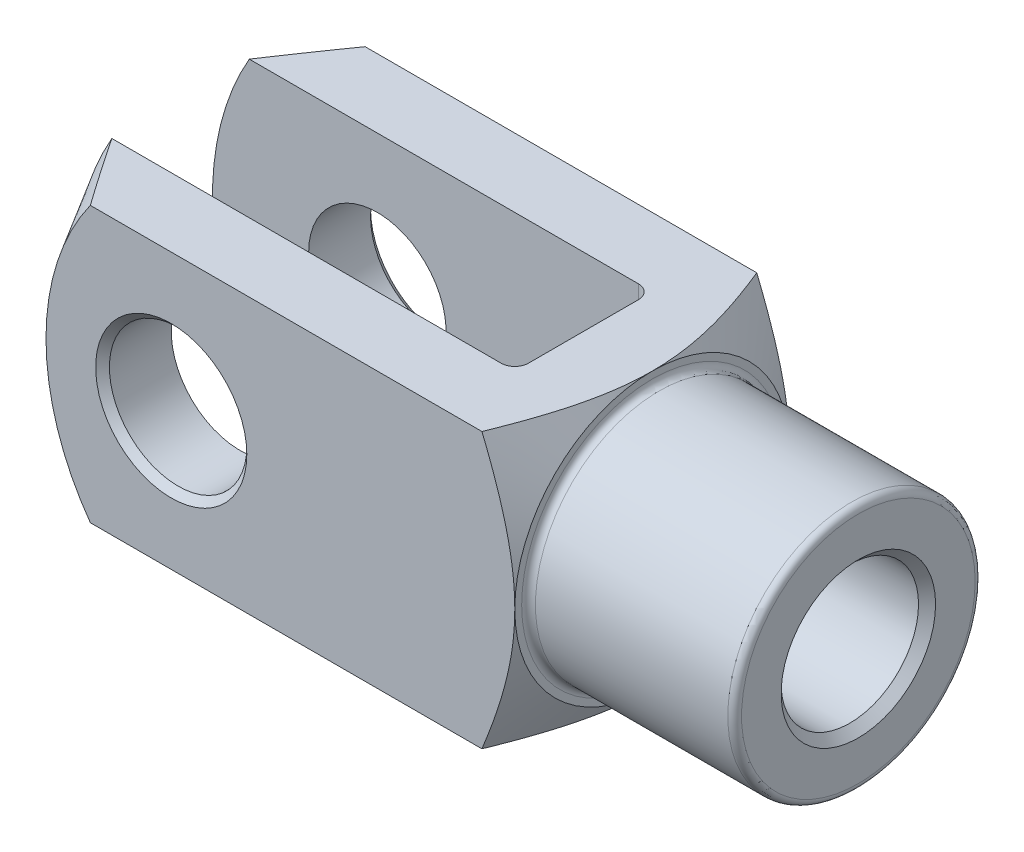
ISO-10303-21;
HEADER;
FILE_DESCRIPTION(('STEP AP214'),'2;1');
FILE_NAME('part.step','',(''),(''),'','','');
FILE_SCHEMA(('AUTOMOTIVE_DESIGN { 1 0 10303 214 1 1 1 1 }'));
ENDSEC;
DATA;
#1=APPLICATION_CONTEXT('core data for automotive mechanical design processes');
#2=APPLICATION_PROTOCOL_DEFINITION('international standard','automotive_design',2000,#1);
#3=PRODUCT_CONTEXT('',#1,'mechanical');
#4=PRODUCT('Part','Part','',(#3));
#5=PRODUCT_RELATED_PRODUCT_CATEGORY('part','',(#4));
#6=PRODUCT_DEFINITION_FORMATION('','',#4);
#7=PRODUCT_DEFINITION_CONTEXT('part definition',#1,'design');
#8=PRODUCT_DEFINITION('design','',#6,#7);
#9=PRODUCT_DEFINITION_SHAPE('','',#8);
#10=(LENGTH_UNIT() NAMED_UNIT(*) SI_UNIT(.MILLI.,.METRE.));
#11=(NAMED_UNIT(*) PLANE_ANGLE_UNIT() SI_UNIT($,.RADIAN.));
#12=(NAMED_UNIT(*) SI_UNIT($,.STERADIAN.) SOLID_ANGLE_UNIT());
#13=UNCERTAINTY_MEASURE_WITH_UNIT(LENGTH_MEASURE(1.E-05),#10,'distance_accuracy_value','');
#14=(GEOMETRIC_REPRESENTATION_CONTEXT(3) GLOBAL_UNCERTAINTY_ASSIGNED_CONTEXT((#13)) GLOBAL_UNIT_ASSIGNED_CONTEXT((#10,
#11,#12)) REPRESENTATION_CONTEXT('',''));
#15=CARTESIAN_POINT('',(0.,0.,0.));
#16=DIRECTION('',(0.,0.,1.));
#17=DIRECTION('',(1.,0.,0.));
#18=AXIS2_PLACEMENT_3D('',#15,#16,#17);
#19=CARTESIAN_POINT('',(-21.,-10.,-3.99999999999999));
#20=DIRECTION('',(0.,-1.,0.));
#21=DIRECTION('',(0.,0.,-1.));
#22=AXIS2_PLACEMENT_3D('',#19,#20,#21);
#23=CYLINDRICAL_SURFACE('',#22,1.);
#24=DIRECTION('',(0.,1.,0.));
#25=VECTOR('',#24,1.);
#26=CARTESIAN_POINT('',(-20.,-10.,-3.99999999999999));
#27=LINE('',#26,#25);
#28=CARTESIAN_POINT('',(-20.,-3.00000000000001,-3.99999999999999));
#29=VERTEX_POINT('',#28);
#30=CARTESIAN_POINT('',(-20.,-10.,-3.99999999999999));
#31=VERTEX_POINT('',#30);
#32=EDGE_CURVE('E357',#29,#31,#27,.F.);
#33=ORIENTED_EDGE('',*,*,#32,.F.);
#34=CARTESIAN_POINT('',(-20.,-3.00000000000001,-3.99999999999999));
#35=CARTESIAN_POINT('',(-20.0000371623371,-2.93694469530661,-4.04730456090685));
#36=CARTESIAN_POINT('',(-20.0033524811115,-2.8728252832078,-4.093051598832));
#37=CARTESIAN_POINT('',(-20.0155357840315,-2.74298227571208,-4.18116773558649));
#38=CARTESIAN_POINT('',(-20.0243931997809,-2.6772619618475,-4.22354309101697));
#39=CARTESIAN_POINT('',(-20.0465893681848,-2.54494770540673,-4.30455906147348));
#40=CARTESIAN_POINT('',(-20.0598973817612,-2.47836268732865,-4.34322301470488));
#41=CARTESIAN_POINT('',(-20.0902730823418,-2.34411430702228,-4.41712604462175));
#42=CARTESIAN_POINT('',(-20.1073432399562,-2.27645026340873,-4.45236284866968));
#43=CARTESIAN_POINT('',(-20.1564689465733,-2.09692992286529,-4.54073885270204));
#44=CARTESIAN_POINT('',(-20.1911463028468,-1.98436263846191,-4.59099447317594));
#45=CARTESIAN_POINT('',(-20.2666906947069,-1.75765553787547,-4.68247844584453));
#46=CARTESIAN_POINT('',(-20.3075603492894,-1.64351507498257,-4.72370296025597));
#47=CARTESIAN_POINT('',(-20.3940114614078,-1.41369488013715,-4.79750849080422));
#48=CARTESIAN_POINT('',(-20.4396106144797,-1.29801088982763,-4.83005529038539));
#49=CARTESIAN_POINT('',(-20.5340479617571,-1.06592793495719,-4.88651783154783));
#50=CARTESIAN_POINT('',(-20.5828851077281,-0.949529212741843,-4.91043635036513));
#51=CARTESIAN_POINT('',(-20.6911535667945,-0.696523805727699,-4.95317913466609));
#52=CARTESIAN_POINT('',(-20.7509805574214,-0.559826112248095,-4.9704595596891));
#53=CARTESIAN_POINT('',(-20.8719499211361,-0.286372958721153,-4.99367348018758));
#54=CARTESIAN_POINT('',(-20.9330893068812,-0.149618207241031,-4.9996304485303));
#55=CARTESIAN_POINT('',(-20.9961510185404,-0.0086065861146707,-4.99999444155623));
#56=CARTESIAN_POINT('',(-20.9980755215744,-0.00430326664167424,-4.99999999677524));
#57=CARTESIAN_POINT('',(-21.,0.,-5.));
#58=B_SPLINE_CURVE_WITH_KNOTS('',3,(#34,#35,#36,#37,#38,#39,#40,#41,#42,#43,#44,#45,#46,#47,#48,
#49,#50,#51,#52,#53,#54,#55,#56,#57),.UNSPECIFIED.,.F.,.F.,(4,2,2,2,2,2,2,2,2,2,2,4),(0.,
0.236272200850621,0.472095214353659,0.706321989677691,0.940703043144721,1.32429275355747,
1.70804515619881,2.09328905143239,2.47840883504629,2.92860728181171,3.37787147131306,
3.39201361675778),.UNSPECIFIED.);
#59=CARTESIAN_POINT('',(-21.,0.,-5.));
#60=VERTEX_POINT('',#59);
#61=EDGE_CURVE('E389',#29,#60,#58,.T.);
#62=ORIENTED_EDGE('',*,*,#61,.T.);
#63=DIRECTION('',(0.,1.,0.));
#64=VECTOR('',#63,1.);
#65=CARTESIAN_POINT('',(-21.,10.,-4.99999999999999));
#66=LINE('',#65,#64);
#67=CARTESIAN_POINT('',(-21.,-10.,-4.99999999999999));
#68=VERTEX_POINT('',#67);
#69=EDGE_CURVE('E183',#68,#60,#66,.T.);
#70=ORIENTED_EDGE('',*,*,#69,.F.);
#71=CARTESIAN_POINT('',(-21.,-10.,-3.99999999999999));
#72=DIRECTION('',(0.,-1.,0.));
#73=DIRECTION('',(0.,0.,-1.));
#74=AXIS2_PLACEMENT_3D('',#71,#72,#73);
#75=CIRCLE('',#74,1.);
#76=EDGE_CURVE('E198',#31,#68,#75,.F.);
#77=ORIENTED_EDGE('',*,*,#76,.F.);
#78=EDGE_LOOP('',(#33,#62,#70,#77));
#79=FACE_BOUND('',#78,.T.);
#80=ADVANCED_FACE('F37',(#79),#23,.F.);
#81=CARTESIAN_POINT('',(-20.,-10.,-4.99999999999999));
#82=DIRECTION('',(1.,0.,0.));
#83=DIRECTION('',(0.,0.,-1.));
#84=AXIS2_PLACEMENT_3D('',#81,#82,#83);
#85=PLANE('',#84);
#86=CARTESIAN_POINT('',(-20.,10.,-3.99999999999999));
#87=VERTEX_POINT('',#86);
#88=CARTESIAN_POINT('',(-20.,3.00000000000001,-3.99999999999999));
#89=VERTEX_POINT('',#88);
#90=EDGE_CURVE('E373',#87,#89,#27,.F.);
#91=ORIENTED_EDGE('',*,*,#90,.T.);
#92=CARTESIAN_POINT('',(-20.,0.,0.));
#93=DIRECTION('',(1.,0.,0.));
#94=DIRECTION('',(0.,0.,-1.));
#95=AXIS2_PLACEMENT_3D('',#92,#93,#94);
#96=CIRCLE('',#95,5.);
#97=CARTESIAN_POINT('',(-20.,3.00000000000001,3.99999999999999));
#98=VERTEX_POINT('',#97);
#99=EDGE_CURVE('E432',#89,#98,#96,.T.);
#100=ORIENTED_EDGE('',*,*,#99,.T.);
#101=DIRECTION('',(0.,1.,0.));
#102=VECTOR('',#101,1.);
#103=CARTESIAN_POINT('',(-20.,10.,3.99999999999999));
#104=LINE('',#103,#102);
#105=CARTESIAN_POINT('',(-20.,10.,3.99999999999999));
#106=VERTEX_POINT('',#105);
#107=EDGE_CURVE('E160',#98,#106,#104,.T.);
#108=ORIENTED_EDGE('',*,*,#107,.T.);
#109=DIRECTION('',(0.,0.,-1.));
#110=VECTOR('',#109,1.);
#111=CARTESIAN_POINT('',(-20.,10.,-4.99999999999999));
#112=LINE('',#111,#110);
#113=EDGE_CURVE('E338',#106,#87,#112,.T.);
#114=ORIENTED_EDGE('',*,*,#113,.T.);
#115=EDGE_LOOP('',(#91,#100,#108,#114));
#116=FACE_BOUND('',#115,.T.);
#117=ADVANCED_FACE('F475',(#116),#85,.F.);
#118=CARTESIAN_POINT('',(-21.,-10.,3.99999999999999));
#119=DIRECTION('',(0.,-1.,0.));
#120=DIRECTION('',(0.,0.,-1.));
#121=AXIS2_PLACEMENT_3D('',#118,#119,#120);
#122=CYLINDRICAL_SURFACE('',#121,1.);
#123=ORIENTED_EDGE('',*,*,#107,.F.);
#124=CARTESIAN_POINT('',(-20.,3.00000000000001,3.99999999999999));
#125=CARTESIAN_POINT('',(-20.0000371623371,2.93694469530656,4.04730456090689));
#126=CARTESIAN_POINT('',(-20.0033524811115,2.87282528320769,4.09305159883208));
#127=CARTESIAN_POINT('',(-20.0155357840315,2.74298227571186,4.18116773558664));
#128=CARTESIAN_POINT('',(-20.0243931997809,2.67726196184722,4.22354309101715));
#129=CARTESIAN_POINT('',(-20.0465893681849,2.54494770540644,4.30455906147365));
#130=CARTESIAN_POINT('',(-20.0598973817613,2.47836268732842,4.34322301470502));
#131=CARTESIAN_POINT('',(-20.0902730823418,2.34411430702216,4.41712604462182));
#132=CARTESIAN_POINT('',(-20.1073432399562,2.27645026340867,4.45236284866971));
#133=CARTESIAN_POINT('',(-20.1564689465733,2.09692992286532,4.54073885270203));
#134=CARTESIAN_POINT('',(-20.1911463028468,1.98436263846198,4.59099447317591));
#135=CARTESIAN_POINT('',(-20.2666906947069,1.75765553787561,4.68247844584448));
#136=CARTESIAN_POINT('',(-20.3075603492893,1.64351507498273,4.72370296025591));
#137=CARTESIAN_POINT('',(-20.3940114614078,1.41369488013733,4.79750849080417));
#138=CARTESIAN_POINT('',(-20.4396106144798,1.29801088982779,4.83005529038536));
#139=CARTESIAN_POINT('',(-20.5340479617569,1.06592793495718,4.88651783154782));
#140=CARTESIAN_POINT('',(-20.5828851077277,0.949529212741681,4.91043635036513));
#141=CARTESIAN_POINT('',(-20.6911535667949,0.696523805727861,4.95317913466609));
#142=CARTESIAN_POINT('',(-20.7509805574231,0.559826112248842,4.97045955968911));
#143=CARTESIAN_POINT('',(-20.8719499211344,0.286372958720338,4.99367348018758));
#144=CARTESIAN_POINT('',(-20.9330893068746,0.149618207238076,4.99963044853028));
#145=CARTESIAN_POINT('',(-20.99615101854,0.00860658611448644,4.99999444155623));
#146=CARTESIAN_POINT('',(-20.9980755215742,0.00430326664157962,4.99999999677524));
#147=CARTESIAN_POINT('',(-21.,0.,5.));
#148=B_SPLINE_CURVE_WITH_KNOTS('',3,(#124,#125,#126,#127,#128,#129,#130,#131,#132,#133,#134,
#135,#136,#137,#138,#139,#140,#141,#142,#143,#144,#145,#146,#147),.UNSPECIFIED.,.F.,.F.,(4,2,2,
2,2,2,2,2,2,2,2,4),(0.,0.236272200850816,0.472095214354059,0.706321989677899,0.940703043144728,
1.32429275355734,1.70804515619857,2.0932890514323,2.47840883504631,2.92860728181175,
3.37787147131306,3.39201361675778),.UNSPECIFIED.);
#149=CARTESIAN_POINT('',(-21.,0.,5.));
#150=VERTEX_POINT('',#149);
#151=EDGE_CURVE('E145',#98,#150,#148,.T.);
#152=ORIENTED_EDGE('',*,*,#151,.T.);
#153=DIRECTION('',(0.,1.,0.));
#154=VECTOR('',#153,1.);
#155=CARTESIAN_POINT('',(-21.,-10.,5.));
#156=LINE('',#155,#154);
#157=CARTESIAN_POINT('',(-21.,10.,5.));
#158=VERTEX_POINT('',#157);
#159=EDGE_CURVE('E159',#158,#150,#156,.F.);
#160=ORIENTED_EDGE('',*,*,#159,.F.);
#161=CARTESIAN_POINT('',(-21.,10.,3.99999999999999));
#162=DIRECTION('',(0.,1.,0.));
#163=DIRECTION('',(0.,0.,1.));
#164=AXIS2_PLACEMENT_3D('',#161,#162,#163);
#165=CIRCLE('',#164,1.);
#166=EDGE_CURVE('E190',#106,#158,#165,.F.);
#167=ORIENTED_EDGE('',*,*,#166,.F.);
#168=EDGE_LOOP('',(#123,#152,#160,#167));
#169=FACE_BOUND('',#168,.T.);
#170=ADVANCED_FACE('F156',(#169),#122,.F.);
#171=CARTESIAN_POINT('',(-52.,-10.,-4.99999999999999));
#172=DIRECTION('',(0.,0.,-1.));
#173=DIRECTION('',(-1.,0.,0.));
#174=AXIS2_PLACEMENT_3D('',#171,#172,#173);
#175=PLANE('',#174);
#176=CARTESIAN_POINT('',(-40.,0.,-4.99999999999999));
#177=DIRECTION('',(0.,0.,-1.));
#178=DIRECTION('',(-1.,0.,0.));
#179=AXIS2_PLACEMENT_3D('',#176,#177,#178);
#180=CIRCLE('',#179,5.);
#181=CARTESIAN_POINT('',(-45.,0.,-4.99999999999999));
#182=VERTEX_POINT('',#181);
#183=EDGE_CURVE('E367',#182,#182,#180,.F.);
#184=ORIENTED_EDGE('',*,*,#183,.F.);
#185=EDGE_LOOP('',(#184));
#186=FACE_BOUND('',#185,.T.);
#187=CARTESIAN_POINT('',(-32.,0.,-4.99999999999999));
#188=DIRECTION('',(0.,0.,1.));
#189=DIRECTION('',(1.,0.,0.));
#190=AXIS2_PLACEMENT_3D('',#187,#188,#189);
#191=CIRCLE('',#190,20.);
#192=CARTESIAN_POINT('',(-49.3205080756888,10.,-4.99999999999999));
#193=VERTEX_POINT('',#192);
#194=CARTESIAN_POINT('',(-49.3205080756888,-10.,-4.99999999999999));
#195=VERTEX_POINT('',#194);
#196=EDGE_CURVE('E276',#193,#195,#191,.T.);
#197=ORIENTED_EDGE('',*,*,#196,.T.);
#198=DIRECTION('',(-1.,0.,0.));
#199=VECTOR('',#198,1.);
#200=CARTESIAN_POINT('',(-52.,-10.,-4.99999999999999));
#201=LINE('',#200,#199);
#202=EDGE_CURVE('E333',#68,#195,#201,.T.);
#203=ORIENTED_EDGE('',*,*,#202,.F.);
#204=ORIENTED_EDGE('',*,*,#69,.T.);
#205=CARTESIAN_POINT('',(-21.,10.,-4.99999999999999));
#206=VERTEX_POINT('',#205);
#207=EDGE_CURVE('E179',#60,#206,#66,.T.);
#208=ORIENTED_EDGE('',*,*,#207,.T.);
#209=DIRECTION('',(-1.,0.,0.));
#210=VECTOR('',#209,1.);
#211=CARTESIAN_POINT('',(-52.,10.,-4.99999999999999));
#212=LINE('',#211,#210);
#213=EDGE_CURVE('E345',#206,#193,#212,.T.);
#214=ORIENTED_EDGE('',*,*,#213,.T.);
#215=EDGE_LOOP('',(#197,#203,#204,#208,#214));
#216=FACE_BOUND('',#215,.T.);
#217=ADVANCED_FACE('F392',(#186,#216),#175,.F.);
#218=CARTESIAN_POINT('',(-52.,-10.,5.));
#219=DIRECTION('',(0.,0.,1.));
#220=DIRECTION('',(1.,0.,0.));
#221=AXIS2_PLACEMENT_3D('',#218,#219,#220);
#222=PLANE('',#221);
#223=CARTESIAN_POINT('',(-40.,0.,5.));
#224=DIRECTION('',(0.,0.,1.));
#225=DIRECTION('',(1.,0.,0.));
#226=AXIS2_PLACEMENT_3D('',#223,#224,#225);
#227=CIRCLE('',#226,5.);
#228=CARTESIAN_POINT('',(-35.,0.,5.));
#229=VERTEX_POINT('',#228);
#230=EDGE_CURVE('E344',#229,#229,#227,.F.);
#231=ORIENTED_EDGE('',*,*,#230,.F.);
#232=EDGE_LOOP('',(#231));
#233=FACE_BOUND('',#232,.T.);
#234=DIRECTION('',(1.,0.,0.));
#235=VECTOR('',#234,1.);
#236=CARTESIAN_POINT('',(-52.,-10.,5.));
#237=LINE('',#236,#235);
#238=CARTESIAN_POINT('',(-49.3205080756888,-10.,5.));
#239=VERTEX_POINT('',#238);
#240=CARTESIAN_POINT('',(-21.,-10.,5.));
#241=VERTEX_POINT('',#240);
#242=EDGE_CURVE('E337',#239,#241,#237,.T.);
#243=ORIENTED_EDGE('',*,*,#242,.F.);
#244=CARTESIAN_POINT('',(-32.,0.,5.));
#245=DIRECTION('',(0.,0.,1.));
#246=DIRECTION('',(1.,0.,0.));
#247=AXIS2_PLACEMENT_3D('',#244,#245,#246);
#248=CIRCLE('',#247,20.);
#249=CARTESIAN_POINT('',(-49.3205080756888,10.,5.));
#250=VERTEX_POINT('',#249);
#251=EDGE_CURVE('E413',#250,#239,#248,.T.);
#252=ORIENTED_EDGE('',*,*,#251,.F.);
#253=DIRECTION('',(1.,0.,0.));
#254=VECTOR('',#253,1.);
#255=CARTESIAN_POINT('',(-52.,10.,5.));
#256=LINE('',#255,#254);
#257=EDGE_CURVE('E176',#250,#158,#256,.T.);
#258=ORIENTED_EDGE('',*,*,#257,.T.);
#259=ORIENTED_EDGE('',*,*,#159,.T.);
#260=EDGE_CURVE('E164',#150,#241,#156,.F.);
#261=ORIENTED_EDGE('',*,*,#260,.T.);
#262=EDGE_LOOP('',(#243,#252,#258,#259,#261));
#263=FACE_BOUND('',#262,.T.);
#264=ADVANCED_FACE('F173',(#233,#263),#222,.F.);
#265=CARTESIAN_POINT('',(-52.,-10.,10.));
#266=DIRECTION('',(0.,0.,1.));
#267=DIRECTION('',(1.,0.,0.));
#268=AXIS2_PLACEMENT_3D('',#265,#266,#267);
#269=PLANE('',#268);
#270=CARTESIAN_POINT('',(-40.,0.,10.));
#271=DIRECTION('',(0.,0.,1.));
#272=DIRECTION('',(1.,0.,0.));
#273=AXIS2_PLACEMENT_3D('',#270,#271,#272);
#274=CIRCLE('',#273,5.49999999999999);
#275=CARTESIAN_POINT('',(-34.5,0.,10.));
#276=VERTEX_POINT('',#275);
#277=EDGE_CURVE('E229',#276,#276,#274,.F.);
#278=ORIENTED_EDGE('',*,*,#277,.T.);
#279=EDGE_LOOP('',(#278));
#280=FACE_BOUND('',#279,.T.);
#281=DIRECTION('',(1.,0.,0.));
#282=VECTOR('',#281,1.);
#283=CARTESIAN_POINT('',(-52.,10.,10.));
#284=LINE('',#283,#282);
#285=CARTESIAN_POINT('',(-45.8875224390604,10.,10.));
#286=VERTEX_POINT('',#285);
#287=CARTESIAN_POINT('',(-17.391463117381,10.,10.));
#288=VERTEX_POINT('',#287);
#289=EDGE_CURVE('E364',#286,#288,#284,.T.);
#290=ORIENTED_EDGE('',*,*,#289,.F.);
#291=CARTESIAN_POINT('',(-32.,0.,10.));
#292=DIRECTION('',(0.,0.,1.));
#293=DIRECTION('',(1.,0.,0.));
#294=AXIS2_PLACEMENT_3D('',#291,#292,#293);
#295=CIRCLE('',#294,17.1132486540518);
#296=CARTESIAN_POINT('',(-45.8875224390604,-10.,10.));
#297=VERTEX_POINT('',#296);
#298=EDGE_CURVE('E61',#286,#297,#295,.T.);
#299=ORIENTED_EDGE('',*,*,#298,.T.);
#300=DIRECTION('',(1.,0.,0.));
#301=VECTOR('',#300,1.);
#302=CARTESIAN_POINT('',(-52.,-10.,10.));
#303=LINE('',#302,#301);
#304=CARTESIAN_POINT('',(-17.391463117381,-10.,10.));
#305=VERTEX_POINT('',#304);
#306=EDGE_CURVE('E361',#297,#305,#303,.T.);
#307=ORIENTED_EDGE('',*,*,#306,.T.);
#308=CARTESIAN_POINT('',(-22.3558734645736,-20.4240435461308,10.));
#309=CARTESIAN_POINT('',(-22.1003465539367,-19.9311836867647,10.));
#310=CARTESIAN_POINT('',(-21.8461705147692,-19.4376169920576,10.));
#311=CARTESIAN_POINT('',(-21.3412365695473,-18.4487061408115,10.));
#312=CARTESIAN_POINT('',(-21.0904788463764,-17.9533618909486,10.));
#313=CARTESIAN_POINT('',(-20.5926922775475,-16.9597202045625,10.));
#314=CARTESIAN_POINT('',(-20.3456706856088,-16.4614191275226,10.));
#315=CARTESIAN_POINT('',(-19.8568264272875,-15.4622801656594,10.));
#316=CARTESIAN_POINT('',(-19.6150036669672,-14.9614423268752,10.));
#317=CARTESIAN_POINT('',(-19.1232043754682,-13.9257515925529,10.));
#318=CARTESIAN_POINT('',(-18.8736415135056,-13.3907016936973,10.));
#319=CARTESIAN_POINT('',(-18.3840144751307,-12.3162208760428,10.));
#320=CARTESIAN_POINT('',(-18.1439507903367,-11.7767897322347,10.));
#321=CARTESIAN_POINT('',(-17.6764473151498,-10.6927476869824,10.));
#322=CARTESIAN_POINT('',(-17.4490019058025,-10.1481392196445,10.));
#323=CARTESIAN_POINT('',(-17.0108100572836,-9.05224110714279,10.));
#324=CARTESIAN_POINT('',(-16.8000616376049,-8.50095226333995,10.));
#325=CARTESIAN_POINT('',(-16.4792530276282,-7.60769970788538,10.));
#326=CARTESIAN_POINT('',(-16.3620787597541,-7.26829451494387,10.));
#327=CARTESIAN_POINT('',(-16.1378183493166,-6.58617800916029,10.));
#328=CARTESIAN_POINT('',(-16.0307313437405,-6.24346698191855,10.));
#329=CARTESIAN_POINT('',(-15.828626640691,-5.55448777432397,10.));
#330=CARTESIAN_POINT('',(-15.733608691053,-5.2082196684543,10.));
#331=CARTESIAN_POINT('',(-15.5579131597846,-4.51203468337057,10.));
#332=CARTESIAN_POINT('',(-15.4772354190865,-4.16211784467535,10.));
#333=CARTESIAN_POINT('',(-15.3343492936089,-3.46705706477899,10.));
#334=CARTESIAN_POINT('',(-15.2717518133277,-3.12199390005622,10.));
#335=CARTESIAN_POINT('',(-15.1647579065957,-2.42903327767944,10.));
#336=CARTESIAN_POINT('',(-15.1203608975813,-2.0811359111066,10.));
#337=CARTESIAN_POINT('',(-15.0516237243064,-1.38356903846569,10.));
#338=CARTESIAN_POINT('',(-15.0272704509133,-1.03390084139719,10.));
#339=CARTESIAN_POINT('',(-14.9996951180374,-0.333728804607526,10.));
#340=CARTESIAN_POINT('',(-14.9964723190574,0.0167750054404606,10.));
#341=CARTESIAN_POINT('',(-15.010762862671,0.691790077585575,10.));
#342=CARTESIAN_POINT('',(-15.0267823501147,1.01633432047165,10.));
#343=CARTESIAN_POINT('',(-15.0764553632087,1.66405607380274,10.));
#344=CARTESIAN_POINT('',(-15.1101088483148,1.98723358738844,10.));
#345=CARTESIAN_POINT('',(-15.1938161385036,2.63160306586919,10.));
#346=CARTESIAN_POINT('',(-15.2438784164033,2.95279391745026,10.));
#347=CARTESIAN_POINT('',(-15.3587527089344,3.59250988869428,10.));
#348=CARTESIAN_POINT('',(-15.4235651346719,3.91103493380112,10.));
#349=CARTESIAN_POINT('',(-15.5682001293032,4.55432870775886,10.));
#350=CARTESIAN_POINT('',(-15.648402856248,4.87901130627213,10.));
#351=CARTESIAN_POINT('',(-15.8205817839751,5.52521807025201,10.));
#352=CARTESIAN_POINT('',(-15.9125580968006,5.84674220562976,10.));
#353=CARTESIAN_POINT('',(-16.1065044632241,6.48673250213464,10.));
#354=CARTESIAN_POINT('',(-16.2084740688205,6.80519879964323,10.));
#355=CARTESIAN_POINT('',(-16.3677555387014,7.28075232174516,10.));
#356=CARTESIAN_POINT('',(-16.4219029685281,7.43891003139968,10.));
#357=CARTESIAN_POINT('',(-16.5321392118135,7.75454715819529,10.));
#358=CARTESIAN_POINT('',(-16.5882280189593,7.91202657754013,10.));
#359=CARTESIAN_POINT('',(-16.7684482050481,8.40910944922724,10.));
#360=CARTESIAN_POINT('',(-16.8958517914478,8.74752927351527,10.));
#361=CARTESIAN_POINT('',(-17.1575763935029,9.42169147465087,10.));
#362=CARTESIAN_POINT('',(-17.2918978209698,9.75743369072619,10.));
#363=CARTESIAN_POINT('',(-17.5663381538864,10.4266152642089,10.));
#364=CARTESIAN_POINT('',(-17.7064582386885,10.7600541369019,10.));
#365=CARTESIAN_POINT('',(-17.9915396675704,11.4248600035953,10.));
#366=CARTESIAN_POINT('',(-18.1365011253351,11.7562269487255,10.));
#367=CARTESIAN_POINT('',(-18.4306248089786,12.4174211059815,10.));
#368=CARTESIAN_POINT('',(-18.579790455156,12.7472467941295,10.));
#369=CARTESIAN_POINT('',(-18.8815899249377,13.4053092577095,10.));
#370=CARTESIAN_POINT('',(-19.0342237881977,13.7335460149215,10.));
#371=CARTESIAN_POINT('',(-19.496500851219,14.7160981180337,10.));
#372=CARTESIAN_POINT('',(-19.8105565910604,15.3683378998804,10.));
#373=CARTESIAN_POINT('',(-20.4483163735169,16.6705289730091,10.));
#374=CARTESIAN_POINT('',(-20.7720469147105,17.3204672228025,10.));
#375=CARTESIAN_POINT('',(-21.4261391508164,18.6170111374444,10.));
#376=CARTESIAN_POINT('',(-21.7565009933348,19.2636167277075,10.));
#377=CARTESIAN_POINT('',(-22.4221745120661,20.5538665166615,10.));
#378=CARTESIAN_POINT('',(-22.7574836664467,21.197512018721,10.));
#379=CARTESIAN_POINT('',(-23.4321254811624,22.4826820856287,10.));
#380=CARTESIAN_POINT('',(-23.7714581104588,23.1242066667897,10.));
#381=CARTESIAN_POINT('',(-24.6929935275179,24.8559334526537,10.));
#382=CARTESIAN_POINT('',(-25.2782369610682,25.9445168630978,10.));
#383=CARTESIAN_POINT('',(-26.4553238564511,28.1183008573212,10.));
#384=CARTESIAN_POINT('',(-27.0471682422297,29.2035009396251,10.));
#385=CARTESIAN_POINT('',(-28.232230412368,31.3650726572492,10.));
#386=CARTESIAN_POINT('',(-28.8254209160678,32.4414592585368,10.));
#387=CARTESIAN_POINT('',(-29.7178280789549,34.0544764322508,10.));
#388=CARTESIAN_POINT('',(-30.0157104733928,34.5918461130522,10.));
#389=CARTESIAN_POINT('',(-30.6122603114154,35.666148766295,10.));
#390=CARTESIAN_POINT('',(-30.9109277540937,36.2030817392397,10.));
#391=CARTESIAN_POINT('',(-31.2099360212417,36.7398248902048,10.));
#392=B_SPLINE_CURVE_WITH_KNOTS('',3,(#308,#309,#310,#311,#312,#313,#314,#315,#316,#317,#318,
#319,#320,#321,#322,#323,#324,#325,#326,#327,#328,#329,#330,#331,#332,#333,#334,#335,#336,#337,
#338,#339,#340,#341,#342,#343,#344,#345,#346,#347,#348,#349,#350,#351,#352,#353,#354,#355,#356,
#357,#358,#359,#360,#361,#362,#363,#364,#365,#366,#367,#368,#369,#370,#371,#372,#373,#374,#375,
#376,#377,#378,#379,#380,#381,#382,#383,#384,#385,#386,#387,#388,#389,#390,#391),.UNSPECIFIED.,
.F.,.F.,(4,2,2,2,2,2,2,2,2,2,2,2,2,2,2,2,2,2,2,2,2,2,2,2,2,2,2,2,2,2,2,2,2,2,2,2,2,2,2,2,2,4),
(0.,1.66549246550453,3.33107368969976,4.99955529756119,6.66800673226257,8.43910594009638,
10.2102966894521,11.980692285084,13.7508775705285,14.8279395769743,15.9049093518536,
16.9818566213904,18.0587919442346,19.1104471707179,20.162068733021,21.2130019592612,
22.2638984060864,23.2382198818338,24.2125391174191,25.1873622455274,26.1622125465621,
27.1652790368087,28.1683550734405,29.1713861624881,29.6728858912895,30.1743839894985,
31.2591028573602,32.3438863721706,33.4288916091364,34.5139223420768,35.59986283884,
36.685815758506,38.857450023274,41.0357057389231,43.2140099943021,45.3912398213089,
47.5684528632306,51.2762079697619,54.9844887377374,58.6715305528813,60.5147611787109,
62.3579896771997),.UNSPECIFIED.);
#393=CARTESIAN_POINT('',(-15.,0.,10.));
#394=VERTEX_POINT('',#393);
#395=EDGE_CURVE('E305',#394,#305,#392,.F.);
#396=ORIENTED_EDGE('',*,*,#395,.F.);
#397=EDGE_CURVE('E303',#288,#394,#392,.F.);
#398=ORIENTED_EDGE('',*,*,#397,.F.);
#399=EDGE_LOOP('',(#290,#299,#307,#396,#398));
#400=FACE_BOUND('',#399,.T.);
#401=ADVANCED_FACE('F287',(#280,#400),#269,.T.);
#402=CARTESIAN_POINT('',(-52.,-10.,10.));
#403=DIRECTION('',(0.,-1.,0.));
#404=DIRECTION('',(0.,0.,-1.));
#405=AXIS2_PLACEMENT_3D('',#402,#403,#404);
#406=PLANE('',#405);
#407=ORIENTED_EDGE('',*,*,#202,.T.);
#408=CARTESIAN_POINT('',(-57.2321898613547,-10.,7.36951687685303));
#409=CARTESIAN_POINT('',(-56.745633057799,-10.,6.58611648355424));
#410=CARTESIAN_POINT('',(-56.2577437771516,-10.,5.80353993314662));
#411=CARTESIAN_POINT('',(-55.2786767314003,-10.,4.24042523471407));
#412=CARTESIAN_POINT('',(-54.7874989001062,-10.,3.45988712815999));
#413=CARTESIAN_POINT('',(-53.8006621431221,-10.,1.90034138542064));
#414=CARTESIAN_POINT('',(-53.3049985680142,-10.,1.12133668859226));
#415=CARTESIAN_POINT('',(-52.3089364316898,-10.,-0.433632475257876));
#416=CARTESIAN_POINT('',(-51.8085379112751,-10.,-1.20959696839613));
#417=CARTESIAN_POINT('',(-50.7809631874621,-10.,-2.78997730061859));
#418=CARTESIAN_POINT('',(-50.253539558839,-10.,-3.59423250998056));
#419=CARTESIAN_POINT('',(-49.1907284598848,-10.,-5.19745714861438));
#420=CARTESIAN_POINT('',(-48.6553410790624,-10.,-5.99642663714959));
#421=CARTESIAN_POINT('',(-47.5747096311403,-10.,-7.58683469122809));
#422=CARTESIAN_POINT('',(-47.0294731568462,-10.,-8.37827839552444));
#423=CARTESIAN_POINT('',(-46.2014533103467,-10.,-9.55828753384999));
#424=CARTESIAN_POINT('',(-45.9237578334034,-10.,-9.95042385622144));
#425=CARTESIAN_POINT('',(-45.364401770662,-10.,-10.7318561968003));
#426=CARTESIAN_POINT('',(-45.0827412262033,-10.,-11.121152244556));
#427=CARTESIAN_POINT('',(-44.5174190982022,-10.,-11.8927308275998));
#428=CARTESIAN_POINT('',(-44.2338006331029,-10.,-12.275044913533));
#429=CARTESIAN_POINT('',(-43.6611630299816,-10.,-13.0356258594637));
#430=CARTESIAN_POINT('',(-43.3721437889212,-10.,-13.4138926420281));
#431=CARTESIAN_POINT('',(-42.7872589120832,-10.,-14.1659406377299));
#432=CARTESIAN_POINT('',(-42.4913844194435,-10.,-14.5397149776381));
#433=CARTESIAN_POINT('',(-41.8918382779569,-10.,-15.2809455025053));
#434=CARTESIAN_POINT('',(-41.5881670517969,-10.,-15.6484020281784));
#435=CARTESIAN_POINT('',(-40.9744614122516,-10.,-16.371451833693));
#436=CARTESIAN_POINT('',(-40.6645256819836,-10.,-16.7271286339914));
#437=CARTESIAN_POINT('',(-40.032968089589,-10.,-17.4282054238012));
#438=CARTESIAN_POINT('',(-39.7113432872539,-10.,-17.7736027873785));
#439=CARTESIAN_POINT('',(-39.2183551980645,-10.,-18.2807263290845));
#440=CARTESIAN_POINT('',(-39.0524514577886,-10.,-18.4477649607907));
#441=CARTESIAN_POINT('',(-38.7165586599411,-10.,-18.7776754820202));
#442=CARTESIAN_POINT('',(-38.5465698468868,-10.,-18.9405476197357));
#443=CARTESIAN_POINT('',(-38.2020749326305,-10.,-19.2612725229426));
#444=CARTESIAN_POINT('',(-38.0275712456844,-10.,-19.4191278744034));
#445=CARTESIAN_POINT('',(-37.6733935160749,-10.,-19.728907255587));
#446=CARTESIAN_POINT('',(-37.4937200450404,-10.,-19.880831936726));
#447=CARTESIAN_POINT('',(-37.1220498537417,-10.,-20.1827912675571));
#448=CARTESIAN_POINT('',(-36.9298420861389,-10.,-20.3325675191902));
#449=CARTESIAN_POINT('',(-36.5383571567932,-10.,-20.6227066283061));
#450=CARTESIAN_POINT('',(-36.3390786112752,-10.,-20.7630676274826));
#451=CARTESIAN_POINT('',(-35.9328460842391,-10.,-21.0319774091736));
#452=CARTESIAN_POINT('',(-35.7258982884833,-10.,-21.1605354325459));
#453=CARTESIAN_POINT('',(-35.3037021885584,-10.,-21.4030294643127));
#454=CARTESIAN_POINT('',(-35.0884560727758,-10.,-21.5169692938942));
#455=CARTESIAN_POINT('',(-34.5296464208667,-10.,-21.783809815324));
#456=CARTESIAN_POINT('',(-34.1798259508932,-10.,-21.9243079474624));
#457=CARTESIAN_POINT('',(-33.6418795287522,-10.,-22.0912640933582));
#458=CARTESIAN_POINT('',(-33.4604354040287,-10.,-22.1396072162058));
#459=CARTESIAN_POINT('',(-33.093915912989,-10.,-22.2200235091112));
#460=CARTESIAN_POINT('',(-32.9088407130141,-10.,-22.2520974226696));
#461=CARTESIAN_POINT('',(-32.5346022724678,-10.,-22.2988166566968));
#462=CARTESIAN_POINT('',(-32.345416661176,-10.,-22.3132845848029));
#463=CARTESIAN_POINT('',(-31.9665401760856,-10.,-22.3235178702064));
#464=CARTESIAN_POINT('',(-31.7768493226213,-10.,-22.3192839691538));
#465=CARTESIAN_POINT('',(-31.3987646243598,-10.,-22.292316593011));
#466=CARTESIAN_POINT('',(-31.2103710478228,-10.,-22.2695794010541));
#467=CARTESIAN_POINT('',(-30.8365348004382,-10.,-22.2066526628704));
#468=CARTESIAN_POINT('',(-30.6510925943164,-10.,-22.1664603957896));
#469=CARTESIAN_POINT('',(-30.2504201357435,-10.,-22.0613497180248));
#470=CARTESIAN_POINT('',(-30.03603297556,-10.,-21.9932307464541));
#471=CARTESIAN_POINT('',(-29.6142317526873,-10.,-21.8379822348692));
#472=CARTESIAN_POINT('',(-29.4068216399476,-10.,-21.7508421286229));
#473=CARTESIAN_POINT('',(-28.9988371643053,-10.,-21.5605082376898));
#474=CARTESIAN_POINT('',(-28.7982845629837,-10.,-21.4572682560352));
#475=CARTESIAN_POINT('',(-28.4045157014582,-10.,-21.2378022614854));
#476=CARTESIAN_POINT('',(-28.211298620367,-10.,-21.121577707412));
#477=CARTESIAN_POINT('',(-27.7694245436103,-10.,-20.8386610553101));
#478=CARTESIAN_POINT('',(-27.5233696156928,-10.,-20.6679192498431));
#479=CARTESIAN_POINT('',(-27.0418236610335,-10.,-20.3120669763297));
#480=CARTESIAN_POINT('',(-26.8063377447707,-10.,-20.1269496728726));
#481=CARTESIAN_POINT('',(-26.3441491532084,-10.,-19.7452386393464));
#482=CARTESIAN_POINT('',(-26.1174642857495,-10.,-19.5486234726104));
#483=CARTESIAN_POINT('',(-25.6720928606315,-10.,-19.1466530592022));
#484=CARTESIAN_POINT('',(-25.4534049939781,-10.,-18.941299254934));
#485=CARTESIAN_POINT('',(-25.0214181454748,-10.,-18.5221818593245));
#486=CARTESIAN_POINT('',(-24.8081650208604,-10.,-18.3083711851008));
#487=CARTESIAN_POINT('',(-24.3876033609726,-10.,-17.8749857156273));
#488=CARTESIAN_POINT('',(-24.1802950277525,-10.,-17.6554107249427));
#489=CARTESIAN_POINT('',(-23.7710307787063,-10.,-17.2117611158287));
#490=CARTESIAN_POINT('',(-23.569069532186,-10.,-16.9876914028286));
#491=CARTESIAN_POINT('',(-23.1696072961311,-10.,-16.5356277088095));
#492=CARTESIAN_POINT('',(-22.9721062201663,-10.,-16.3076338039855));
#493=CARTESIAN_POINT('',(-22.4999897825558,-10.,-15.7532280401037));
#494=CARTESIAN_POINT('',(-22.2273152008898,-10.,-15.4251642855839));
#495=CARTESIAN_POINT('',(-21.6883836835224,-10.,-14.7637172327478));
#496=CARTESIAN_POINT('',(-21.4221280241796,-10.,-14.4303328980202));
#497=CARTESIAN_POINT('',(-20.8990947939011,-10.,-13.7644395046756));
#498=CARTESIAN_POINT('',(-20.6422345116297,-10.,-13.4319952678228));
#499=CARTESIAN_POINT('',(-20.1331161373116,-10.,-12.7637580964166));
#500=CARTESIAN_POINT('',(-19.8808566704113,-10.,-12.4279662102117));
#501=CARTESIAN_POINT('',(-19.6304831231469,-10.,-12.0907921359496));
#502=B_SPLINE_CURVE_WITH_KNOTS('',3,(#408,#409,#410,#411,#412,#413,#414,#415,#416,#417,#418,
#419,#420,#421,#422,#423,#424,#425,#426,#427,#428,#429,#430,#431,#432,#433,#434,#435,#436,#437,
#438,#439,#440,#441,#442,#443,#444,#445,#446,#447,#448,#449,#450,#451,#452,#453,#454,#455,#456,
#457,#458,#459,#460,#461,#462,#463,#464,#465,#466,#467,#468,#469,#470,#471,#472,#473,#474,#475,
#476,#477,#478,#479,#480,#481,#482,#483,#484,#485,#486,#487,#488,#489,#490,#491,#492,#493,#494,
#495,#496,#497,#498,#499,#500,#501),.UNSPECIFIED.,.F.,.F.,(4,2,2,2,2,2,2,2,2,2,2,2,2,2,2,2,2,2,
2,2,2,2,2,2,2,2,2,2,2,2,2,2,2,2,2,2,2,2,2,2,2,2,2,2,2,2,4),(0.,2.76660478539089,
5.53326542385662,8.30322881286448,11.0731683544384,13.9584410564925,16.8436813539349,
19.7267850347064,21.1682825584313,22.6097650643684,24.037812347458,25.4658869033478,
26.8959225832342,28.325880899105,29.7410059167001,31.1564893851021,31.8627134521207,
32.5688953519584,33.2747071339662,33.980441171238,34.7112197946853,35.4421422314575,
36.1724874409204,36.902641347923,38.0289522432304,38.5916651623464,39.1543523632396,
39.7226632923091,40.2909516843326,40.859354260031,41.4278454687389,42.1016117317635,
42.7757532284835,43.4518659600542,44.1279028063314,45.0256730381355,45.9238727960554,
46.8238041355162,47.7235875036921,48.6293923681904,49.535227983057,50.4401236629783,
51.3450017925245,52.6246585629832,53.9045677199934,55.1648707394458,56.4247907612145),.UNSPECIFIED.);
#503=CARTESIAN_POINT('',(-45.8875224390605,-10.,-10.));
#504=VERTEX_POINT('',#503);
#505=EDGE_CURVE('E275',#195,#504,#502,.T.);
#506=ORIENTED_EDGE('',*,*,#505,.T.);
#507=DIRECTION('',(1.,0.,0.));
#508=VECTOR('',#507,1.);
#509=CARTESIAN_POINT('',(-52.,-10.,-10.));
#510=LINE('',#509,#508);
#511=CARTESIAN_POINT('',(-17.391463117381,-10.,-10.));
#512=VERTEX_POINT('',#511);
#513=EDGE_CURVE('E358',#504,#512,#510,.T.);
#514=ORIENTED_EDGE('',*,*,#513,.T.);
#515=CARTESIAN_POINT('',(-22.3558734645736,-10.,-20.4240435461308));
#516=CARTESIAN_POINT('',(-22.1003465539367,-10.,-19.9311836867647));
#517=CARTESIAN_POINT('',(-21.8461705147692,-10.,-19.4376169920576));
#518=CARTESIAN_POINT('',(-21.3412365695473,-10.,-18.4487061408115));
#519=CARTESIAN_POINT('',(-21.0904788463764,-10.,-17.9533618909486));
#520=CARTESIAN_POINT('',(-20.5926922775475,-10.,-16.9597202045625));
#521=CARTESIAN_POINT('',(-20.3456706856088,-10.,-16.4614191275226));
#522=CARTESIAN_POINT('',(-19.8568264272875,-10.,-15.4622801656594));
#523=CARTESIAN_POINT('',(-19.6150036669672,-10.,-14.9614423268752));
#524=CARTESIAN_POINT('',(-19.1232043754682,-10.,-13.9257515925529));
#525=CARTESIAN_POINT('',(-18.8736415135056,-10.,-13.3907016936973));
#526=CARTESIAN_POINT('',(-18.3840144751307,-10.,-12.3162208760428));
#527=CARTESIAN_POINT('',(-18.1439507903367,-10.,-11.7767897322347));
#528=CARTESIAN_POINT('',(-17.6764473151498,-10.,-10.6927476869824));
#529=CARTESIAN_POINT('',(-17.4490019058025,-10.,-10.1481392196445));
#530=CARTESIAN_POINT('',(-17.0108100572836,-10.,-9.05224110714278));
#531=CARTESIAN_POINT('',(-16.8000616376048,-10.,-8.50095226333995));
#532=CARTESIAN_POINT('',(-16.4792530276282,-10.,-7.60769970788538));
#533=CARTESIAN_POINT('',(-16.3620787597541,-10.,-7.26829451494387));
#534=CARTESIAN_POINT('',(-16.1378183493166,-10.,-6.58617800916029));
#535=CARTESIAN_POINT('',(-16.0307313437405,-10.,-6.24346698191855));
#536=CARTESIAN_POINT('',(-15.828626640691,-10.,-5.55448777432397));
#537=CARTESIAN_POINT('',(-15.733608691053,-10.,-5.2082196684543));
#538=CARTESIAN_POINT('',(-15.5579131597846,-10.,-4.51203468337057));
#539=CARTESIAN_POINT('',(-15.4772354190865,-10.,-4.16211784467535));
#540=CARTESIAN_POINT('',(-15.3343492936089,-10.,-3.46705706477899));
#541=CARTESIAN_POINT('',(-15.2717518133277,-10.,-3.12199390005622));
#542=CARTESIAN_POINT('',(-15.1647579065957,-10.,-2.42903327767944));
#543=CARTESIAN_POINT('',(-15.1203608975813,-10.,-2.0811359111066));
#544=CARTESIAN_POINT('',(-15.0516237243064,-10.,-1.38356903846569));
#545=CARTESIAN_POINT('',(-15.0272704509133,-10.,-1.03390084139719));
#546=CARTESIAN_POINT('',(-14.9996951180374,-10.,-0.333728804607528));
#547=CARTESIAN_POINT('',(-14.9964723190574,-10.,0.0167750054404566));
#548=CARTESIAN_POINT('',(-15.010762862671,-10.,0.691790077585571));
#549=CARTESIAN_POINT('',(-15.0267823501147,-10.,1.01633432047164));
#550=CARTESIAN_POINT('',(-15.0764553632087,-10.,1.66405607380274));
#551=CARTESIAN_POINT('',(-15.1101088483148,-10.,1.98723358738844));
#552=CARTESIAN_POINT('',(-15.1938161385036,-10.,2.63160306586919));
#553=CARTESIAN_POINT('',(-15.2438784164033,-10.,2.95279391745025));
#554=CARTESIAN_POINT('',(-15.3587527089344,-10.,3.59250988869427));
#555=CARTESIAN_POINT('',(-15.4235651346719,-10.,3.91103493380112));
#556=CARTESIAN_POINT('',(-15.5682001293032,-10.,4.55432870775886));
#557=CARTESIAN_POINT('',(-15.648402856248,-10.,4.87901130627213));
#558=CARTESIAN_POINT('',(-15.8205817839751,-10.,5.525218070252));
#559=CARTESIAN_POINT('',(-15.9125580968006,-10.,5.84674220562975));
#560=CARTESIAN_POINT('',(-16.1065044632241,-10.,6.48673250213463));
#561=CARTESIAN_POINT('',(-16.2084740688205,-10.,6.80519879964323));
#562=CARTESIAN_POINT('',(-16.3677555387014,-10.,7.28075232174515));
#563=CARTESIAN_POINT('',(-16.4219029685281,-10.,7.43891003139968));
#564=CARTESIAN_POINT('',(-16.5321392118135,-10.,7.75454715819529));
#565=CARTESIAN_POINT('',(-16.5882280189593,-10.,7.91202657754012));
#566=CARTESIAN_POINT('',(-16.7684482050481,-10.,8.40910944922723));
#567=CARTESIAN_POINT('',(-16.8958517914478,-10.,8.74752927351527));
#568=CARTESIAN_POINT('',(-17.1575763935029,-10.,9.42169147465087));
#569=CARTESIAN_POINT('',(-17.2918978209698,-10.,9.75743369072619));
#570=CARTESIAN_POINT('',(-17.5663381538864,-10.,10.4266152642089));
#571=CARTESIAN_POINT('',(-17.7064582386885,-10.,10.7600541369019));
#572=CARTESIAN_POINT('',(-17.9915396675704,-10.,11.4248600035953));
#573=CARTESIAN_POINT('',(-18.1365011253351,-10.,11.7562269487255));
#574=CARTESIAN_POINT('',(-18.4306248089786,-10.,12.4174211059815));
#575=CARTESIAN_POINT('',(-18.579790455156,-10.,12.7472467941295));
#576=CARTESIAN_POINT('',(-18.8815899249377,-10.,13.4053092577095));
#577=CARTESIAN_POINT('',(-19.0342237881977,-10.,13.7335460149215));
#578=CARTESIAN_POINT('',(-19.496500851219,-10.,14.7160981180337));
#579=CARTESIAN_POINT('',(-19.8105565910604,-10.,15.3683378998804));
#580=CARTESIAN_POINT('',(-20.4483163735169,-10.,16.6705289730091));
#581=CARTESIAN_POINT('',(-20.7720469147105,-10.,17.3204672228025));
#582=CARTESIAN_POINT('',(-21.4261391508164,-10.,18.6170111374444));
#583=CARTESIAN_POINT('',(-21.7565009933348,-10.,19.2636167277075));
#584=CARTESIAN_POINT('',(-22.4221745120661,-10.,20.5538665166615));
#585=CARTESIAN_POINT('',(-22.7574836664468,-10.,21.1975120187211));
#586=CARTESIAN_POINT('',(-23.4321254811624,-10.,22.4826820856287));
#587=CARTESIAN_POINT('',(-23.7714581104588,-10.,23.1242066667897));
#588=CARTESIAN_POINT('',(-24.6929935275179,-10.,24.8559334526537));
#589=CARTESIAN_POINT('',(-25.2782369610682,-10.,25.9445168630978));
#590=CARTESIAN_POINT('',(-26.4553238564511,-10.,28.1183008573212));
#591=CARTESIAN_POINT('',(-27.0471682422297,-10.,29.2035009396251));
#592=CARTESIAN_POINT('',(-28.2322304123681,-10.,31.3650726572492));
#593=CARTESIAN_POINT('',(-28.8254209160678,-10.,32.4414592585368));
#594=CARTESIAN_POINT('',(-29.7178280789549,-10.,34.0544764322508));
#595=CARTESIAN_POINT('',(-30.0157104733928,-10.,34.5918461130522));
#596=CARTESIAN_POINT('',(-30.6122603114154,-10.,35.6661487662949));
#597=CARTESIAN_POINT('',(-30.9109277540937,-10.,36.2030817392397));
#598=CARTESIAN_POINT('',(-31.2099360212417,-10.,36.7398248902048));
#599=B_SPLINE_CURVE_WITH_KNOTS('',3,(#515,#516,#517,#518,#519,#520,#521,#522,#523,#524,#525,
#526,#527,#528,#529,#530,#531,#532,#533,#534,#535,#536,#537,#538,#539,#540,#541,#542,#543,#544,
#545,#546,#547,#548,#549,#550,#551,#552,#553,#554,#555,#556,#557,#558,#559,#560,#561,#562,#563,
#564,#565,#566,#567,#568,#569,#570,#571,#572,#573,#574,#575,#576,#577,#578,#579,#580,#581,#582,
#583,#584,#585,#586,#587,#588,#589,#590,#591,#592,#593,#594,#595,#596,#597,#598),.UNSPECIFIED.,
.F.,.F.,(4,2,2,2,2,2,2,2,2,2,2,2,2,2,2,2,2,2,2,2,2,2,2,2,2,2,2,2,2,2,2,2,2,2,2,2,2,2,2,2,2,4),
(0.,1.66549246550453,3.33107368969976,4.99955529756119,6.66800673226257,8.43910594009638,
10.2102966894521,11.980692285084,13.7508775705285,14.8279395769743,15.9049093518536,
16.9818566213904,18.0587919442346,19.1104471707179,20.162068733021,21.2130019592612,
22.2638984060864,23.2382198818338,24.2125391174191,25.1873622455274,26.1622125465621,
27.1652790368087,28.1683550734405,29.1713861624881,29.6728858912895,30.1743839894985,
31.2591028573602,32.3438863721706,33.4288916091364,34.5139223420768,35.59986283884,
36.685815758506,38.857450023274,41.0357057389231,43.2140099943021,45.3912398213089,
47.5684528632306,51.2762079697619,54.9844887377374,58.6715305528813,60.5147611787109,
62.3579896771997),.UNSPECIFIED.);
#600=CARTESIAN_POINT('',(-15.,-10.,0.));
#601=VERTEX_POINT('',#600);
#602=EDGE_CURVE('E304',#601,#512,#599,.F.);
#603=ORIENTED_EDGE('',*,*,#602,.F.);
#604=EDGE_CURVE('E295',#305,#601,#599,.F.);
#605=ORIENTED_EDGE('',*,*,#604,.F.);
#606=ORIENTED_EDGE('',*,*,#306,.F.);
#607=CARTESIAN_POINT('',(-19.6304831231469,-10.,12.0907921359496));
#608=CARTESIAN_POINT('',(-19.8338762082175,-10.,12.3647242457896));
#609=CARTESIAN_POINT('',(-20.0385262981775,-10.,12.6377302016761));
#610=CARTESIAN_POINT('',(-20.4507369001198,-10.,13.181565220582));
#611=CARTESIAN_POINT('',(-20.6582976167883,-10.,13.4523941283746));
#612=CARTESIAN_POINT('',(-21.0770682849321,-10.,13.9919897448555));
#613=CARTESIAN_POINT('',(-21.2882840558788,-10.,14.2607519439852));
#614=CARTESIAN_POINT('',(-21.7144777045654,-10.,14.7952707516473));
#615=CARTESIAN_POINT('',(-21.9294554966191,-10.,15.0610274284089));
#616=CARTESIAN_POINT('',(-22.3658843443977,-10.,15.5915807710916));
#617=CARTESIAN_POINT('',(-22.5873782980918,-10.,15.8563422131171));
#618=CARTESIAN_POINT('',(-23.0354910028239,-10.,16.3814896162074));
#619=CARTESIAN_POINT('',(-23.2621096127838,-10.,16.6418756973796));
#620=CARTESIAN_POINT('',(-23.7211922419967,-10.,17.1571482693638));
#621=CARTESIAN_POINT('',(-23.9536523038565,-10.,17.4120382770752));
#622=CARTESIAN_POINT('',(-24.4255997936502,-10.,17.9152070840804));
#623=CARTESIAN_POINT('',(-24.665086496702,-10.,18.163486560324));
#624=CARTESIAN_POINT('',(-25.1139682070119,-10.,18.6132180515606));
#625=CARTESIAN_POINT('',(-25.3221499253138,-10.,18.8158782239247));
#626=CARTESIAN_POINT('',(-25.7454021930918,-10.,19.2139465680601));
#627=CARTESIAN_POINT('',(-25.9604733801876,-10.,19.4093540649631));
#628=CARTESIAN_POINT('',(-26.3987029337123,-10.,19.7911821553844));
#629=CARTESIAN_POINT('',(-26.6218657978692,-10.,19.9775976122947));
#630=CARTESIAN_POINT('',(-27.0773953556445,-10.,20.3388644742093));
#631=CARTESIAN_POINT('',(-27.3097609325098,-10.,20.5137172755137));
#632=CARTESIAN_POINT('',(-27.7515604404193,-10.,20.8249743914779));
#633=CARTESIAN_POINT('',(-27.9596155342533,-10.,20.9633255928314));
#634=CARTESIAN_POINT('',(-28.3843394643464,-10.,21.2263210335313));
#635=CARTESIAN_POINT('',(-28.6010095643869,-10.,21.3509632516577));
#636=CARTESIAN_POINT('',(-29.0427392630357,-10.,21.5826745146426));
#637=CARTESIAN_POINT('',(-29.2677692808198,-10.,21.6897994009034));
#638=CARTESIAN_POINT('',(-29.7267727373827,-10.,21.8827967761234));
#639=CARTESIAN_POINT('',(-29.9607405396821,-10.,21.9686824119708));
#640=CARTESIAN_POINT('',(-30.3615778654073,-10.,22.0917690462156));
#641=CARTESIAN_POINT('',(-30.5263625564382,-10.,22.1357833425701));
#642=CARTESIAN_POINT('',(-30.8589152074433,-10.,22.2104461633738));
#643=CARTESIAN_POINT('',(-31.0266821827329,-10.,22.2410990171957));
#644=CARTESIAN_POINT('',(-31.3641457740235,-10.,22.2879722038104));
#645=CARTESIAN_POINT('',(-31.5338413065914,-10.,22.3042002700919));
#646=CARTESIAN_POINT('',(-31.8740129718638,-10.,22.3216361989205));
#647=CARTESIAN_POINT('',(-32.0444891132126,-10.,22.3228438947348));
#648=CARTESIAN_POINT('',(-32.3849548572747,-10.,22.3101874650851));
#649=CARTESIAN_POINT('',(-32.5549441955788,-10.,22.2963163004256));
#650=CARTESIAN_POINT('',(-32.8930850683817,-10.,22.254024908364));
#651=CARTESIAN_POINT('',(-33.0612365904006,-10.,22.2256045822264));
#652=CARTESIAN_POINT('',(-33.3947372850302,-10.,22.1552039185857));
#653=CARTESIAN_POINT('',(-33.5600850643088,-10.,22.1132170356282));
#654=CARTESIAN_POINT('',(-33.8871598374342,-10.,22.0169946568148));
#655=CARTESIAN_POINT('',(-34.0488863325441,-10.,21.9627574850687));
#656=CARTESIAN_POINT('',(-34.4585882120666,-10.,21.8097172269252));
#657=CARTESIAN_POINT('',(-34.7036369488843,-10.,21.7030534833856));
#658=CARTESIAN_POINT('',(-35.183328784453,-10.,21.4684665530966));
#659=CARTESIAN_POINT('',(-35.4179646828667,-10.,21.340528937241));
#660=CARTESIAN_POINT('',(-35.8781923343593,-10.,21.0673698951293));
#661=CARTESIAN_POINT('',(-36.1037425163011,-10.,20.9220789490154));
#662=CARTESIAN_POINT('',(-36.4351087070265,-10.,20.694253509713));
#663=CARTESIAN_POINT('',(-36.5443890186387,-10.,20.6166754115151));
#664=CARTESIAN_POINT('',(-36.760789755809,-10.,20.4585635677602));
#665=CARTESIAN_POINT('',(-36.867910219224,-10.,20.3780298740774));
#666=CARTESIAN_POINT('',(-37.1887234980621,-10.,20.1305689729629));
#667=CARTESIAN_POINT('',(-37.39928659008,-10.,19.9595758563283));
#668=CARTESIAN_POINT('',(-37.81317555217,-10.,19.6090088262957));
#669=CARTESIAN_POINT('',(-38.0164996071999,-10.,19.4294327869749));
#670=CARTESIAN_POINT('',(-38.4169939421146,-10.,19.0631978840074));
#671=CARTESIAN_POINT('',(-38.6141583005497,-10.,18.8765325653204));
#672=CARTESIAN_POINT('',(-39.0029346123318,-10.,18.4975570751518));
#673=CARTESIAN_POINT('',(-39.1945470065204,-10.,18.3052473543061));
#674=CARTESIAN_POINT('',(-39.57361034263,-10.,17.9152543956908));
#675=CARTESIAN_POINT('',(-39.7610441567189,-10.,17.7175545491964));
#676=CARTESIAN_POINT('',(-40.1316526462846,-10.,17.3181961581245));
#677=CARTESIAN_POINT('',(-40.3148271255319,-10.,17.116537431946));
#678=CARTESIAN_POINT('',(-40.8585638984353,-10.,16.5067806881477));
#679=CARTESIAN_POINT('',(-41.2135375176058,-10.,16.0936958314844));
#680=CARTESIAN_POINT('',(-41.9161186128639,-10.,15.2526377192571));
#681=CARTESIAN_POINT('',(-42.263579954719,-10.,14.8245433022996));
#682=CARTESIAN_POINT('',(-42.9489926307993,-10.,13.9607593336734));
#683=CARTESIAN_POINT('',(-43.2869430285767,-10.,13.5250690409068));
#684=CARTESIAN_POINT('',(-43.9543933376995,-10.,12.6487798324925));
#685=CARTESIAN_POINT('',(-44.283910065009,-10.,12.208193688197));
#686=CARTESIAN_POINT('',(-44.9366302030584,-10.,11.3223637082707));
#687=CARTESIAN_POINT('',(-45.2598334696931,-10.,10.8771197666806));
#688=CARTESIAN_POINT('',(-46.1076555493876,-10.,9.69467023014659));
#689=CARTESIAN_POINT('',(-46.6278136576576,-10.,8.95426810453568));
#690=CARTESIAN_POINT('',(-47.6574557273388,-10.,7.46606978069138));
#691=CARTESIAN_POINT('',(-48.1669393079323,-10.,6.7182733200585));
#692=CARTESIAN_POINT('',(-49.1780504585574,-10.,5.21641287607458));
#693=CARTESIAN_POINT('',(-49.6796705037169,-10.,4.46234383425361));
#694=CARTESIAN_POINT('',(-50.6763124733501,-10.,2.94985825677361));
#695=CARTESIAN_POINT('',(-51.1713343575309,-10.,2.1914416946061));
#696=CARTESIAN_POINT('',(-52.1357984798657,-10.,0.702425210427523));
#697=CARTESIAN_POINT('',(-52.605455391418,-10.,-0.0280358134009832));
#698=CARTESIAN_POINT('',(-53.5407231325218,-10.,-1.49154753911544));
#699=CARTESIAN_POINT('',(-54.0063339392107,-10.,-2.2245982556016));
#700=CARTESIAN_POINT('',(-54.9336174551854,-10.,-3.69194744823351));
#701=CARTESIAN_POINT('',(-55.3952942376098,-10.,-4.42624335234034));
#702=CARTESIAN_POINT('',(-56.3157719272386,-10.,-5.8966209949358));
#703=CARTESIAN_POINT('',(-56.7745728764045,-10.,-6.6327027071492));
#704=CARTESIAN_POINT('',(-57.2321898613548,-10.,-7.36951687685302));
#705=B_SPLINE_CURVE_WITH_KNOTS('',3,(#607,#608,#609,#610,#611,#612,#613,#614,#615,#616,#617,
#618,#619,#620,#621,#622,#623,#624,#625,#626,#627,#628,#629,#630,#631,#632,#633,#634,#635,#636,
#637,#638,#639,#640,#641,#642,#643,#644,#645,#646,#647,#648,#649,#650,#651,#652,#653,#654,#655,
#656,#657,#658,#659,#660,#661,#662,#663,#664,#665,#666,#667,#668,#669,#670,#671,#672,#673,#674,
#675,#676,#677,#678,#679,#680,#681,#682,#683,#684,#685,#686,#687,#688,#689,#690,#691,#692,#693,
#694,#695,#696,#697,#698,#699,#700,#701,#702,#703,#704),.UNSPECIFIED.,.F.,.F.,(4,2,2,2,2,2,2,2,
2,2,2,2,2,2,2,2,2,2,2,2,2,2,2,2,2,2,2,2,2,2,2,2,2,2,2,2,2,2,2,2,2,2,2,2,2,2,2,2,4),(0.,
1.02356148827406,2.04719532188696,3.07264470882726,4.0980707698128,5.13359453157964,
6.16908982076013,7.203901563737,8.23860692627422,9.11007358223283,9.98162112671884,
10.8536607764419,11.7255949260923,12.474739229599,13.2239938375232,13.9708113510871,
14.7171654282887,15.228368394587,15.7394055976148,16.250168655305,16.7609373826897,
17.2719446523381,17.7829553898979,18.2942130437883,18.8055406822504,19.6059279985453,
20.4068604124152,21.2111164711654,21.6131287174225,22.0151339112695,22.8285637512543,
23.6421961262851,24.4565879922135,25.2709150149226,26.0881240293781,26.9053706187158,
28.5390066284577,30.1929212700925,31.8469981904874,33.4974692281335,35.1479778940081,
37.8623986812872,40.5769161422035,43.2938895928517,46.010879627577,48.6161197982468,
51.2213746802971,53.823486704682,56.4255606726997),.UNSPECIFIED.);
#706=EDGE_CURVE('E266',#297,#239,#705,.T.);
#707=ORIENTED_EDGE('',*,*,#706,.T.);
#708=ORIENTED_EDGE('',*,*,#242,.T.);
#709=CARTESIAN_POINT('',(-21.,-10.,3.99999999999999));
#710=DIRECTION('',(0.,-1.,0.));
#711=DIRECTION('',(0.,0.,-1.));
#712=AXIS2_PLACEMENT_3D('',#709,#710,#711);
#713=CIRCLE('',#712,1.);
#714=CARTESIAN_POINT('',(-20.,-10.,3.99999999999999));
#715=VERTEX_POINT('',#714);
#716=EDGE_CURVE('E166',#241,#715,#713,.F.);
#717=ORIENTED_EDGE('',*,*,#716,.T.);
#718=DIRECTION('',(0.,0.,-1.));
#719=VECTOR('',#718,1.);
#720=CARTESIAN_POINT('',(-20.,-10.,-4.99999999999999));
#721=LINE('',#720,#719);
#722=EDGE_CURVE('E340',#715,#31,#721,.T.);
#723=ORIENTED_EDGE('',*,*,#722,.T.);
#724=ORIENTED_EDGE('',*,*,#76,.T.);
#725=EDGE_LOOP('',(#407,#506,#514,#603,#605,#606,#707,#708,#717,#723,#724));
#726=FACE_BOUND('',#725,.T.);
#727=ADVANCED_FACE('F282',(#726),#406,.T.);
#728=CARTESIAN_POINT('',(-52.,-10.,-10.));
#729=DIRECTION('',(0.,0.,-1.));
#730=DIRECTION('',(-1.,0.,0.));
#731=AXIS2_PLACEMENT_3D('',#728,#729,#730);
#732=PLANE('',#731);
#733=CARTESIAN_POINT('',(-40.,0.,-10.));
#734=DIRECTION('',(0.,0.,-1.));
#735=DIRECTION('',(-1.,0.,0.));
#736=AXIS2_PLACEMENT_3D('',#733,#734,#735);
#737=CIRCLE('',#736,5.49999999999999);
#738=CARTESIAN_POINT('',(-45.5,0.,-10.));
#739=VERTEX_POINT('',#738);
#740=EDGE_CURVE('E217',#739,#739,#737,.F.);
#741=ORIENTED_EDGE('',*,*,#740,.T.);
#742=EDGE_LOOP('',(#741));
#743=FACE_BOUND('',#742,.T.);
#744=ORIENTED_EDGE('',*,*,#513,.F.);
#745=CARTESIAN_POINT('',(-32.,0.,-10.));
#746=DIRECTION('',(0.,0.,1.));
#747=DIRECTION('',(1.,0.,0.));
#748=AXIS2_PLACEMENT_3D('',#745,#746,#747);
#749=CIRCLE('',#748,17.1132486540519);
#750=CARTESIAN_POINT('',(-45.8875224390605,10.,-10.));
#751=VERTEX_POINT('',#750);
#752=EDGE_CURVE('E405',#751,#504,#749,.T.);
#753=ORIENTED_EDGE('',*,*,#752,.F.);
#754=DIRECTION('',(1.,0.,0.));
#755=VECTOR('',#754,1.);
#756=CARTESIAN_POINT('',(-52.,10.,-10.));
#757=LINE('',#756,#755);
#758=CARTESIAN_POINT('',(-17.391463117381,10.,-10.));
#759=VERTEX_POINT('',#758);
#760=EDGE_CURVE('E354',#751,#759,#757,.T.);
#761=ORIENTED_EDGE('',*,*,#760,.T.);
#762=CARTESIAN_POINT('',(-22.3558734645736,-20.4240435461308,-10.));
#763=CARTESIAN_POINT('',(-22.1003465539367,-19.9311836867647,-10.));
#764=CARTESIAN_POINT('',(-21.8461705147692,-19.4376169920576,-10.));
#765=CARTESIAN_POINT('',(-21.3412365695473,-18.4487061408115,-10.));
#766=CARTESIAN_POINT('',(-21.0904788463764,-17.9533618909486,-10.));
#767=CARTESIAN_POINT('',(-20.5926922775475,-16.9597202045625,-10.));
#768=CARTESIAN_POINT('',(-20.3456706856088,-16.4614191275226,-10.));
#769=CARTESIAN_POINT('',(-19.8568264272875,-15.4622801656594,-10.));
#770=CARTESIAN_POINT('',(-19.6150036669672,-14.9614423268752,-10.));
#771=CARTESIAN_POINT('',(-19.1232043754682,-13.9257515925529,-10.));
#772=CARTESIAN_POINT('',(-18.8736415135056,-13.3907016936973,-10.));
#773=CARTESIAN_POINT('',(-18.3840144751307,-12.3162208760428,-10.));
#774=CARTESIAN_POINT('',(-18.1439507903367,-11.7767897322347,-10.));
#775=CARTESIAN_POINT('',(-17.6764473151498,-10.6927476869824,-10.));
#776=CARTESIAN_POINT('',(-17.4490019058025,-10.1481392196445,-10.));
#777=CARTESIAN_POINT('',(-17.0108100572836,-9.05224110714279,-10.));
#778=CARTESIAN_POINT('',(-16.8000616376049,-8.50095226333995,-10.));
#779=CARTESIAN_POINT('',(-16.4792530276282,-7.60769970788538,-10.));
#780=CARTESIAN_POINT('',(-16.3620787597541,-7.26829451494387,-10.));
#781=CARTESIAN_POINT('',(-16.1378183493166,-6.58617800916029,-10.));
#782=CARTESIAN_POINT('',(-16.0307313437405,-6.24346698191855,-10.));
#783=CARTESIAN_POINT('',(-15.828626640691,-5.55448777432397,-10.));
#784=CARTESIAN_POINT('',(-15.733608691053,-5.2082196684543,-10.));
#785=CARTESIAN_POINT('',(-15.5579131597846,-4.51203468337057,-10.));
#786=CARTESIAN_POINT('',(-15.4772354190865,-4.16211784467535,-10.));
#787=CARTESIAN_POINT('',(-15.3343492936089,-3.46705706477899,-10.));
#788=CARTESIAN_POINT('',(-15.2717518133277,-3.12199390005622,-10.));
#789=CARTESIAN_POINT('',(-15.1647579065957,-2.42903327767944,-10.));
#790=CARTESIAN_POINT('',(-15.1203608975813,-2.0811359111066,-10.));
#791=CARTESIAN_POINT('',(-15.0516237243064,-1.38356903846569,-10.));
#792=CARTESIAN_POINT('',(-15.0272704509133,-1.03390084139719,-10.));
#793=CARTESIAN_POINT('',(-14.9996951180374,-0.333728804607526,-10.));
#794=CARTESIAN_POINT('',(-14.9964723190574,0.0167750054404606,-10.));
#795=CARTESIAN_POINT('',(-15.010762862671,0.691790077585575,-10.));
#796=CARTESIAN_POINT('',(-15.0267823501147,1.01633432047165,-10.));
#797=CARTESIAN_POINT('',(-15.0764553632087,1.66405607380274,-10.));
#798=CARTESIAN_POINT('',(-15.1101088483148,1.98723358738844,-10.));
#799=CARTESIAN_POINT('',(-15.1938161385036,2.63160306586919,-10.));
#800=CARTESIAN_POINT('',(-15.2438784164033,2.95279391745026,-10.));
#801=CARTESIAN_POINT('',(-15.3587527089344,3.59250988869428,-10.));
#802=CARTESIAN_POINT('',(-15.4235651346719,3.91103493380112,-10.));
#803=CARTESIAN_POINT('',(-15.5682001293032,4.55432870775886,-10.));
#804=CARTESIAN_POINT('',(-15.648402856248,4.87901130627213,-10.));
#805=CARTESIAN_POINT('',(-15.8205817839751,5.52521807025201,-10.));
#806=CARTESIAN_POINT('',(-15.9125580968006,5.84674220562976,-10.));
#807=CARTESIAN_POINT('',(-16.1065044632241,6.48673250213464,-10.));
#808=CARTESIAN_POINT('',(-16.2084740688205,6.80519879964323,-10.));
#809=CARTESIAN_POINT('',(-16.3677555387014,7.28075232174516,-10.));
#810=CARTESIAN_POINT('',(-16.4219029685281,7.43891003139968,-10.));
#811=CARTESIAN_POINT('',(-16.5321392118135,7.75454715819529,-10.));
#812=CARTESIAN_POINT('',(-16.5882280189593,7.91202657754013,-10.));
#813=CARTESIAN_POINT('',(-16.7684482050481,8.40910944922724,-10.));
#814=CARTESIAN_POINT('',(-16.8958517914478,8.74752927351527,-10.));
#815=CARTESIAN_POINT('',(-17.1575763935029,9.42169147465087,-10.));
#816=CARTESIAN_POINT('',(-17.2918978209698,9.75743369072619,-10.));
#817=CARTESIAN_POINT('',(-17.5663381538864,10.4266152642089,-10.));
#818=CARTESIAN_POINT('',(-17.7064582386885,10.7600541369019,-10.));
#819=CARTESIAN_POINT('',(-17.9915396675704,11.4248600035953,-10.));
#820=CARTESIAN_POINT('',(-18.1365011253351,11.7562269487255,-10.));
#821=CARTESIAN_POINT('',(-18.4306248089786,12.4174211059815,-10.));
#822=CARTESIAN_POINT('',(-18.579790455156,12.7472467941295,-10.));
#823=CARTESIAN_POINT('',(-18.8815899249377,13.4053092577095,-10.));
#824=CARTESIAN_POINT('',(-19.0342237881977,13.7335460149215,-10.));
#825=CARTESIAN_POINT('',(-19.496500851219,14.7160981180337,-10.));
#826=CARTESIAN_POINT('',(-19.8105565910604,15.3683378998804,-10.));
#827=CARTESIAN_POINT('',(-20.4483163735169,16.6705289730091,-10.));
#828=CARTESIAN_POINT('',(-20.7720469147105,17.3204672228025,-10.));
#829=CARTESIAN_POINT('',(-21.4261391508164,18.6170111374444,-10.));
#830=CARTESIAN_POINT('',(-21.7565009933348,19.2636167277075,-10.));
#831=CARTESIAN_POINT('',(-22.4221745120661,20.5538665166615,-10.));
#832=CARTESIAN_POINT('',(-22.7574836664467,21.197512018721,-10.));
#833=CARTESIAN_POINT('',(-23.4321254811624,22.4826820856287,-10.));
#834=CARTESIAN_POINT('',(-23.7714581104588,23.1242066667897,-10.));
#835=CARTESIAN_POINT('',(-24.6929935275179,24.8559334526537,-10.));
#836=CARTESIAN_POINT('',(-25.2782369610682,25.9445168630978,-10.));
#837=CARTESIAN_POINT('',(-26.4553238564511,28.1183008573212,-10.));
#838=CARTESIAN_POINT('',(-27.0471682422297,29.2035009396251,-10.));
#839=CARTESIAN_POINT('',(-28.232230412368,31.3650726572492,-10.));
#840=CARTESIAN_POINT('',(-28.8254209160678,32.4414592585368,-10.));
#841=CARTESIAN_POINT('',(-29.7178280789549,34.0544764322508,-10.));
#842=CARTESIAN_POINT('',(-30.0157104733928,34.5918461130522,-10.));
#843=CARTESIAN_POINT('',(-30.6122603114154,35.666148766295,-10.));
#844=CARTESIAN_POINT('',(-30.9109277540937,36.2030817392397,-10.));
#845=CARTESIAN_POINT('',(-31.2099360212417,36.7398248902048,-10.));
#846=B_SPLINE_CURVE_WITH_KNOTS('',3,(#762,#763,#764,#765,#766,#767,#768,#769,#770,#771,#772,
#773,#774,#775,#776,#777,#778,#779,#780,#781,#782,#783,#784,#785,#786,#787,#788,#789,#790,#791,
#792,#793,#794,#795,#796,#797,#798,#799,#800,#801,#802,#803,#804,#805,#806,#807,#808,#809,#810,
#811,#812,#813,#814,#815,#816,#817,#818,#819,#820,#821,#822,#823,#824,#825,#826,#827,#828,#829,
#830,#831,#832,#833,#834,#835,#836,#837,#838,#839,#840,#841,#842,#843,#844,#845),.UNSPECIFIED.,
.F.,.F.,(4,2,2,2,2,2,2,2,2,2,2,2,2,2,2,2,2,2,2,2,2,2,2,2,2,2,2,2,2,2,2,2,2,2,2,2,2,2,2,2,2,4),
(0.,1.66549246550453,3.33107368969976,4.99955529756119,6.66800673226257,8.43910594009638,
10.2102966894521,11.980692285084,13.7508775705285,14.8279395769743,15.9049093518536,
16.9818566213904,18.0587919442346,19.1104471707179,20.162068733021,21.2130019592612,
22.2638984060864,23.2382198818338,24.2125391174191,25.1873622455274,26.1622125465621,
27.1652790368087,28.1683550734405,29.1713861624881,29.6728858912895,30.1743839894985,
31.2591028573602,32.3438863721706,33.4288916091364,34.5139223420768,35.59986283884,
36.685815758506,38.857450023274,41.0357057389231,43.2140099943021,45.3912398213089,
47.5684528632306,51.2762079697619,54.9844887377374,58.6715305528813,60.5147611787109,
62.3579896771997),.UNSPECIFIED.);
#847=CARTESIAN_POINT('',(-15.,0.,-10.));
#848=VERTEX_POINT('',#847);
#849=EDGE_CURVE('E325',#848,#759,#846,.T.);
#850=ORIENTED_EDGE('',*,*,#849,.F.);
#851=EDGE_CURVE('E332',#512,#848,#846,.T.);
#852=ORIENTED_EDGE('',*,*,#851,.F.);
#853=EDGE_LOOP('',(#744,#753,#761,#850,#852));
#854=FACE_BOUND('',#853,.T.);
#855=ADVANCED_FACE('F286',(#743,#854),#732,.T.);
#856=CARTESIAN_POINT('',(-52.,10.,10.));
#857=DIRECTION('',(0.,1.,0.));
#858=DIRECTION('',(0.,0.,1.));
#859=AXIS2_PLACEMENT_3D('',#856,#857,#858);
#860=PLANE('',#859);
#861=ORIENTED_EDGE('',*,*,#760,.F.);
#862=CARTESIAN_POINT('',(-19.6304831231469,10.,-12.0907921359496));
#863=CARTESIAN_POINT('',(-19.8338762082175,10.,-12.3647242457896));
#864=CARTESIAN_POINT('',(-20.0385262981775,10.,-12.6377302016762));
#865=CARTESIAN_POINT('',(-20.4507369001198,10.,-13.181565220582));
#866=CARTESIAN_POINT('',(-20.6582976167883,10.,-13.4523941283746));
#867=CARTESIAN_POINT('',(-21.0770682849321,10.,-13.9919897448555));
#868=CARTESIAN_POINT('',(-21.2882840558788,10.,-14.2607519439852));
#869=CARTESIAN_POINT('',(-21.7144777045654,10.,-14.7952707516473));
#870=CARTESIAN_POINT('',(-21.9294554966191,10.,-15.0610274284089));
#871=CARTESIAN_POINT('',(-22.3658843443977,10.,-15.5915807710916));
#872=CARTESIAN_POINT('',(-22.5873782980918,10.,-15.8563422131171));
#873=CARTESIAN_POINT('',(-23.0354910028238,10.,-16.3814896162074));
#874=CARTESIAN_POINT('',(-23.2621096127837,10.,-16.6418756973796));
#875=CARTESIAN_POINT('',(-23.7211922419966,10.,-17.1571482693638));
#876=CARTESIAN_POINT('',(-23.9536523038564,10.,-17.4120382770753));
#877=CARTESIAN_POINT('',(-24.4255997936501,10.,-17.9152070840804));
#878=CARTESIAN_POINT('',(-24.6650864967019,10.,-18.163486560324));
#879=CARTESIAN_POINT('',(-25.1139682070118,10.,-18.6132180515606));
#880=CARTESIAN_POINT('',(-25.3221499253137,10.,-18.8158782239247));
#881=CARTESIAN_POINT('',(-25.7454021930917,10.,-19.2139465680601));
#882=CARTESIAN_POINT('',(-25.9604733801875,10.,-19.4093540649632));
#883=CARTESIAN_POINT('',(-26.3987029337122,10.,-19.7911821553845));
#884=CARTESIAN_POINT('',(-26.6218657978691,10.,-19.9775976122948));
#885=CARTESIAN_POINT('',(-27.0773953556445,10.,-20.3388644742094));
#886=CARTESIAN_POINT('',(-27.3097609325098,10.,-20.5137172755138));
#887=CARTESIAN_POINT('',(-27.7515604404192,10.,-20.824974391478));
#888=CARTESIAN_POINT('',(-27.9596155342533,10.,-20.9633255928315));
#889=CARTESIAN_POINT('',(-28.3843394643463,10.,-21.2263210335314));
#890=CARTESIAN_POINT('',(-28.6010095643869,10.,-21.3509632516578));
#891=CARTESIAN_POINT('',(-29.0427392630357,10.,-21.5826745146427));
#892=CARTESIAN_POINT('',(-29.2677692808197,10.,-21.6897994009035));
#893=CARTESIAN_POINT('',(-29.7267727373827,10.,-21.8827967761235));
#894=CARTESIAN_POINT('',(-29.960740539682,10.,-21.9686824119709));
#895=CARTESIAN_POINT('',(-30.3615778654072,10.,-22.0917690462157));
#896=CARTESIAN_POINT('',(-30.5263625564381,10.,-22.1357833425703));
#897=CARTESIAN_POINT('',(-30.8589152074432,10.,-22.2104461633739));
#898=CARTESIAN_POINT('',(-31.0266821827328,10.,-22.2410990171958));
#899=CARTESIAN_POINT('',(-31.3641457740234,10.,-22.2879722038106));
#900=CARTESIAN_POINT('',(-31.5338413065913,10.,-22.304200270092));
#901=CARTESIAN_POINT('',(-31.8740129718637,10.,-22.3216361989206));
#902=CARTESIAN_POINT('',(-32.0444891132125,10.,-22.3228438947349));
#903=CARTESIAN_POINT('',(-32.3849548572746,10.,-22.3101874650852));
#904=CARTESIAN_POINT('',(-32.5549441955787,10.,-22.2963163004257));
#905=CARTESIAN_POINT('',(-32.8930850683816,10.,-22.2540249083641));
#906=CARTESIAN_POINT('',(-33.0612365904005,10.,-22.2256045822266));
#907=CARTESIAN_POINT('',(-33.3947372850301,10.,-22.1552039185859));
#908=CARTESIAN_POINT('',(-33.5600850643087,10.,-22.1132170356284));
#909=CARTESIAN_POINT('',(-33.8871598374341,10.,-22.016994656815));
#910=CARTESIAN_POINT('',(-34.048886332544,10.,-21.9627574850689));
#911=CARTESIAN_POINT('',(-34.4585882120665,10.,-21.8097172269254));
#912=CARTESIAN_POINT('',(-34.7036369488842,10.,-21.7030534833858));
#913=CARTESIAN_POINT('',(-35.1833287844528,10.,-21.4684665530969));
#914=CARTESIAN_POINT('',(-35.4179646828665,10.,-21.3405289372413));
#915=CARTESIAN_POINT('',(-35.8781923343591,10.,-21.0673698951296));
#916=CARTESIAN_POINT('',(-36.1037425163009,10.,-20.9220789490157));
#917=CARTESIAN_POINT('',(-36.4351087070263,10.,-20.6942535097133));
#918=CARTESIAN_POINT('',(-36.5443890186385,10.,-20.6166754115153));
#919=CARTESIAN_POINT('',(-36.7607897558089,10.,-20.4585635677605));
#920=CARTESIAN_POINT('',(-36.8679102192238,10.,-20.3780298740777));
#921=CARTESIAN_POINT('',(-37.1887234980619,10.,-20.1305689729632));
#922=CARTESIAN_POINT('',(-37.3992865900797,10.,-19.9595758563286));
#923=CARTESIAN_POINT('',(-37.8131755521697,10.,-19.6090088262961));
#924=CARTESIAN_POINT('',(-38.0164996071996,10.,-19.4294327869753));
#925=CARTESIAN_POINT('',(-38.4169939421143,10.,-19.0631978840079));
#926=CARTESIAN_POINT('',(-38.6141583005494,10.,-18.8765325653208));
#927=CARTESIAN_POINT('',(-39.0029346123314,10.,-18.4975570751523));
#928=CARTESIAN_POINT('',(-39.19454700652,10.,-18.3052473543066));
#929=CARTESIAN_POINT('',(-39.5736103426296,10.,-17.9152543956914));
#930=CARTESIAN_POINT('',(-39.7610441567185,10.,-17.7175545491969));
#931=CARTESIAN_POINT('',(-40.1316526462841,10.,-17.3181961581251));
#932=CARTESIAN_POINT('',(-40.3148271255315,10.,-17.1165374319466));
#933=CARTESIAN_POINT('',(-40.8585638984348,10.,-16.5067806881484));
#934=CARTESIAN_POINT('',(-41.2135375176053,10.,-16.0936958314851));
#935=CARTESIAN_POINT('',(-41.9161186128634,10.,-15.2526377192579));
#936=CARTESIAN_POINT('',(-42.2635799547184,10.,-14.8245433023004));
#937=CARTESIAN_POINT('',(-42.9489926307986,10.,-13.9607593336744));
#938=CARTESIAN_POINT('',(-43.286943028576,10.,-13.5250690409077));
#939=CARTESIAN_POINT('',(-43.9543933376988,10.,-12.6487798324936));
#940=CARTESIAN_POINT('',(-44.2839100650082,10.,-12.2081936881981));
#941=CARTESIAN_POINT('',(-44.9366302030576,10.,-11.3223637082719));
#942=CARTESIAN_POINT('',(-45.2598334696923,10.,-10.8771197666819));
#943=CARTESIAN_POINT('',(-46.1076555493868,10.,-9.6946702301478));
#944=CARTESIAN_POINT('',(-46.6278136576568,10.,-8.95426810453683));
#945=CARTESIAN_POINT('',(-47.6574557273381,10.,-7.46606978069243));
#946=CARTESIAN_POINT('',(-48.1669393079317,10.,-6.71827332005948));
#947=CARTESIAN_POINT('',(-49.1780504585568,10.,-5.21641287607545));
#948=CARTESIAN_POINT('',(-49.6796705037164,10.,-4.46234383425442));
#949=CARTESIAN_POINT('',(-50.6763124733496,10.,-2.94985825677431));
#950=CARTESIAN_POINT('',(-51.1713343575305,10.,-2.19144169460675));
#951=CARTESIAN_POINT('',(-52.1357984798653,10.,-0.702425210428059));
#952=CARTESIAN_POINT('',(-52.6054553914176,10.,0.0280358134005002));
#953=CARTESIAN_POINT('',(-53.5407231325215,10.,1.49154753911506));
#954=CARTESIAN_POINT('',(-54.0063339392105,10.,2.22459825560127));
#955=CARTESIAN_POINT('',(-54.9336174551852,10.,3.69194744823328));
#956=CARTESIAN_POINT('',(-55.3952942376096,10.,4.42624335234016));
#957=CARTESIAN_POINT('',(-56.3157719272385,10.,5.89662099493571));
#958=CARTESIAN_POINT('',(-56.7745728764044,10.,6.63270270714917));
#959=CARTESIAN_POINT('',(-57.2321898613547,10.,7.36951687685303));
#960=B_SPLINE_CURVE_WITH_KNOTS('',3,(#862,#863,#864,#865,#866,#867,#868,#869,#870,#871,#872,
#873,#874,#875,#876,#877,#878,#879,#880,#881,#882,#883,#884,#885,#886,#887,#888,#889,#890,#891,
#892,#893,#894,#895,#896,#897,#898,#899,#900,#901,#902,#903,#904,#905,#906,#907,#908,#909,#910,
#911,#912,#913,#914,#915,#916,#917,#918,#919,#920,#921,#922,#923,#924,#925,#926,#927,#928,#929,
#930,#931,#932,#933,#934,#935,#936,#937,#938,#939,#940,#941,#942,#943,#944,#945,#946,#947,#948,
#949,#950,#951,#952,#953,#954,#955,#956,#957,#958,#959),.UNSPECIFIED.,.F.,.F.,(4,2,2,2,2,2,2,2,
2,2,2,2,2,2,2,2,2,2,2,2,2,2,2,2,2,2,2,2,2,2,2,2,2,2,2,2,2,2,2,2,2,2,2,2,2,2,2,2,4),(0.,
1.02356148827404,2.04719532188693,3.07264470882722,4.09807076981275,5.13359453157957,
6.16908982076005,7.20390156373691,8.23860692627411,9.11007358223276,9.9816211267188,
10.8536607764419,11.7255949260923,12.474739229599,13.2239938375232,13.9708113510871,
14.7171654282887,15.2283683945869,15.7394055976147,16.250168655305,16.7609373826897,
17.2719446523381,17.7829553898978,18.2942130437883,18.8055406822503,19.6059279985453,
20.4068604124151,21.2111164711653,21.6131287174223,22.0151339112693,22.828563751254,
23.6421961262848,24.4565879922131,25.2709150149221,26.0881240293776,26.9053706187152,
28.5390066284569,30.1929212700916,31.8469981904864,33.4974692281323,35.1479778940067,
37.862398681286,40.5769161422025,43.293889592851,46.0108796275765,48.6161197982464,
51.2213746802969,53.823486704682,56.4255606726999),.UNSPECIFIED.);
#961=EDGE_CURVE('E246',#751,#193,#960,.T.);
#962=ORIENTED_EDGE('',*,*,#961,.T.);
#963=ORIENTED_EDGE('',*,*,#213,.F.);
#964=CARTESIAN_POINT('',(-21.,10.,-3.99999999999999));
#965=DIRECTION('',(0.,1.,0.));
#966=DIRECTION('',(0.,0.,1.));
#967=AXIS2_PLACEMENT_3D('',#964,#965,#966);
#968=CIRCLE('',#967,1.);
#969=EDGE_CURVE('E195',#206,#87,#968,.F.);
#970=ORIENTED_EDGE('',*,*,#969,.T.);
#971=ORIENTED_EDGE('',*,*,#113,.F.);
#972=ORIENTED_EDGE('',*,*,#166,.T.);
#973=ORIENTED_EDGE('',*,*,#257,.F.);
#974=CARTESIAN_POINT('',(-57.2321898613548,10.,-7.36951687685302));
#975=CARTESIAN_POINT('',(-56.7456330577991,10.,-6.58611648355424));
#976=CARTESIAN_POINT('',(-56.2577437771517,10.,-5.80353993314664));
#977=CARTESIAN_POINT('',(-55.2786767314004,10.,-4.24042523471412));
#978=CARTESIAN_POINT('',(-54.7874989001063,10.,-3.45988712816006));
#979=CARTESIAN_POINT('',(-53.8006621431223,10.,-1.90034138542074));
#980=CARTESIAN_POINT('',(-53.3049985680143,10.,-1.12133668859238));
#981=CARTESIAN_POINT('',(-52.30893643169,10.,0.433632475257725));
#982=CARTESIAN_POINT('',(-51.8085379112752,10.,1.20959696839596));
#983=CARTESIAN_POINT('',(-50.7809631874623,10.,2.78997730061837));
#984=CARTESIAN_POINT('',(-50.2535395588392,10.,3.59423250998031));
#985=CARTESIAN_POINT('',(-49.190728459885,10.,5.19745714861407));
#986=CARTESIAN_POINT('',(-48.6553410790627,10.,5.99642663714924));
#987=CARTESIAN_POINT('',(-47.5747096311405,10.,7.58683469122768));
#988=CARTESIAN_POINT('',(-47.0294731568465,10.,8.378278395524));
#989=CARTESIAN_POINT('',(-46.201453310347,10.,9.55828753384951));
#990=CARTESIAN_POINT('',(-45.9237578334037,10.,9.95042385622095));
#991=CARTESIAN_POINT('',(-45.3644017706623,10.,10.7318561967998));
#992=CARTESIAN_POINT('',(-45.0827412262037,10.,11.1211522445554));
#993=CARTESIAN_POINT('',(-44.5174190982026,10.,11.8927308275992));
#994=CARTESIAN_POINT('',(-44.2338006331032,10.,12.2750449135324));
#995=CARTESIAN_POINT('',(-43.661163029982,10.,13.0356258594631));
#996=CARTESIAN_POINT('',(-43.3721437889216,10.,13.4138926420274));
#997=CARTESIAN_POINT('',(-42.7872589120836,10.,14.1659406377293));
#998=CARTESIAN_POINT('',(-42.491384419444,10.,14.5397149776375));
#999=CARTESIAN_POINT('',(-41.8918382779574,10.,15.2809455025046));
#1000=CARTESIAN_POINT('',(-41.5881670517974,10.,15.6484020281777));
#1001=CARTESIAN_POINT('',(-40.9744614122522,10.,16.3714518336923));
#1002=CARTESIAN_POINT('',(-40.6645256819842,10.,16.7271286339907));
#1003=CARTESIAN_POINT('',(-40.0329680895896,10.,17.4282054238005));
#1004=CARTESIAN_POINT('',(-39.7113432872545,10.,17.7736027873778));
#1005=CARTESIAN_POINT('',(-39.2183551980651,10.,18.2807263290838));
#1006=CARTESIAN_POINT('',(-39.0524514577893,10.,18.44776496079));
#1007=CARTESIAN_POINT('',(-38.7165586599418,10.,18.7776754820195));
#1008=CARTESIAN_POINT('',(-38.5465698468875,10.,18.9405476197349));
#1009=CARTESIAN_POINT('',(-38.2020749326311,10.,19.2612725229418));
#1010=CARTESIAN_POINT('',(-38.027571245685,10.,19.4191278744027));
#1011=CARTESIAN_POINT('',(-37.6733935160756,10.,19.7289072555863));
#1012=CARTESIAN_POINT('',(-37.4937200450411,10.,19.8808319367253));
#1013=CARTESIAN_POINT('',(-37.1220498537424,10.,20.1827912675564));
#1014=CARTESIAN_POINT('',(-36.9298420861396,10.,20.3325675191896));
#1015=CARTESIAN_POINT('',(-36.5383571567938,10.,20.6227066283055));
#1016=CARTESIAN_POINT('',(-36.3390786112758,10.,20.7630676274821));
#1017=CARTESIAN_POINT('',(-35.9328460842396,10.,21.0319774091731));
#1018=CARTESIAN_POINT('',(-35.7258982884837,10.,21.1605354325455));
#1019=CARTESIAN_POINT('',(-35.3037021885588,10.,21.4030294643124));
#1020=CARTESIAN_POINT('',(-35.0884560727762,10.,21.5169692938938));
#1021=CARTESIAN_POINT('',(-34.529646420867,10.,21.7838098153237));
#1022=CARTESIAN_POINT('',(-34.1798259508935,10.,21.9243079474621));
#1023=CARTESIAN_POINT('',(-33.6418795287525,10.,22.0912640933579));
#1024=CARTESIAN_POINT('',(-33.460435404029,10.,22.1396072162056));
#1025=CARTESIAN_POINT('',(-33.0939159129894,10.,22.220023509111));
#1026=CARTESIAN_POINT('',(-32.9088407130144,10.,22.2520974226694));
#1027=CARTESIAN_POINT('',(-32.5346022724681,10.,22.2988166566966));
#1028=CARTESIAN_POINT('',(-32.3454166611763,10.,22.3132845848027));
#1029=CARTESIAN_POINT('',(-31.9665401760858,10.,22.3235178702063));
#1030=CARTESIAN_POINT('',(-31.7768493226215,10.,22.3192839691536));
#1031=CARTESIAN_POINT('',(-31.39876462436,10.,22.2923165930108));
#1032=CARTESIAN_POINT('',(-31.2103710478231,10.,22.269579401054));
#1033=CARTESIAN_POINT('',(-30.8365348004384,10.,22.2066526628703));
#1034=CARTESIAN_POINT('',(-30.6510925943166,10.,22.1664603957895));
#1035=CARTESIAN_POINT('',(-30.2504201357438,10.,22.0613497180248));
#1036=CARTESIAN_POINT('',(-30.0360329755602,10.,21.9932307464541));
#1037=CARTESIAN_POINT('',(-29.6142317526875,10.,21.8379822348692));
#1038=CARTESIAN_POINT('',(-29.4068216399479,10.,21.7508421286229));
#1039=CARTESIAN_POINT('',(-28.9988371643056,10.,21.5605082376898));
#1040=CARTESIAN_POINT('',(-28.798284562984,10.,21.4572682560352));
#1041=CARTESIAN_POINT('',(-28.4045157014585,10.,21.2378022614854));
#1042=CARTESIAN_POINT('',(-28.2112986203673,10.,21.1215777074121));
#1043=CARTESIAN_POINT('',(-27.7694245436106,10.,20.8386610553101));
#1044=CARTESIAN_POINT('',(-27.5233696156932,10.,20.6679192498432));
#1045=CARTESIAN_POINT('',(-27.0418236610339,10.,20.3120669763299));
#1046=CARTESIAN_POINT('',(-26.8063377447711,10.,20.1269496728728));
#1047=CARTESIAN_POINT('',(-26.3441491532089,10.,19.7452386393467));
#1048=CARTESIAN_POINT('',(-26.11746428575,10.,19.5486234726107));
#1049=CARTESIAN_POINT('',(-25.672092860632,10.,19.1466530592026));
#1050=CARTESIAN_POINT('',(-25.4534049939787,10.,18.9412992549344));
#1051=CARTESIAN_POINT('',(-25.0214181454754,10.,18.522181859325));
#1052=CARTESIAN_POINT('',(-24.808165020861,10.,18.3083711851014));
#1053=CARTESIAN_POINT('',(-24.3876033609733,10.,17.8749857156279));
#1054=CARTESIAN_POINT('',(-24.1802950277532,10.,17.6554107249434));
#1055=CARTESIAN_POINT('',(-23.7710307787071,10.,17.2117611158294));
#1056=CARTESIAN_POINT('',(-23.5690695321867,10.,16.9876914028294));
#1057=CARTESIAN_POINT('',(-23.1696072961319,10.,16.5356277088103));
#1058=CARTESIAN_POINT('',(-22.9721062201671,10.,16.3076338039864));
#1059=CARTESIAN_POINT('',(-22.4999897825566,10.,15.7532280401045));
#1060=CARTESIAN_POINT('',(-22.2273152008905,10.,15.4251642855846));
#1061=CARTESIAN_POINT('',(-21.688383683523,10.,14.7637172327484));
#1062=CARTESIAN_POINT('',(-21.42212802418,10.,14.4303328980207));
#1063=CARTESIAN_POINT('',(-20.8990947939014,10.,13.764439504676));
#1064=CARTESIAN_POINT('',(-20.64223451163,10.,13.431995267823));
#1065=CARTESIAN_POINT('',(-20.1331161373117,10.,12.7637580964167));
#1066=CARTESIAN_POINT('',(-19.8808566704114,10.,12.4279662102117));
#1067=CARTESIAN_POINT('',(-19.6304831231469,10.,12.0907921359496));
#1068=B_SPLINE_CURVE_WITH_KNOTS('',3,(#974,#975,#976,#977,#978,#979,#980,#981,#982,#983,#984,
#985,#986,#987,#988,#989,#990,#991,#992,#993,#994,#995,#996,#997,#998,#999,#1000,#1001,#1002,
#1003,#1004,#1005,#1006,#1007,#1008,#1009,#1010,#1011,#1012,#1013,#1014,#1015,#1016,#1017,#1018,
#1019,#1020,#1021,#1022,#1023,#1024,#1025,#1026,#1027,#1028,#1029,#1030,#1031,#1032,#1033,#1034,
#1035,#1036,#1037,#1038,#1039,#1040,#1041,#1042,#1043,#1044,#1045,#1046,#1047,#1048,#1049,#1050,
#1051,#1052,#1053,#1054,#1055,#1056,#1057,#1058,#1059,#1060,#1061,#1062,#1063,#1064,#1065,#1066,
#1067),.UNSPECIFIED.,.F.,.F.,(4,2,2,2,2,2,2,2,2,2,2,2,2,2,2,2,2,2,2,2,2,2,2,2,2,2,2,2,2,2,2,2,2,
2,2,2,2,2,2,2,2,2,2,2,2,2,4),(0.,2.76660478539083,5.53326542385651,8.30322881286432,
11.0731683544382,13.9584410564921,16.8436813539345,19.7267850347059,21.1682825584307,
22.6097650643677,24.0378123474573,25.4658869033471,26.8959225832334,28.3258808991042,
29.7410059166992,31.1564893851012,31.8627134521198,32.5688953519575,33.2747071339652,
33.980441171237,34.7112197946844,35.4421422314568,36.1724874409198,36.9026413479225,
38.0289522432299,38.591665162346,39.1543523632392,39.7226632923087,40.2909516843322,
40.8593542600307,41.4278454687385,42.1016117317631,42.7757532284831,43.4518659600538,
44.127902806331,45.025673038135,45.9238727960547,46.8238041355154,47.7235875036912,
48.6293923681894,49.5352279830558,50.440123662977,51.3450017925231,52.6246585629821,
53.9045677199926,55.1648707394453,56.4247907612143),.UNSPECIFIED.);
#1069=EDGE_CURVE('E239',#250,#286,#1068,.T.);
#1070=ORIENTED_EDGE('',*,*,#1069,.T.);
#1071=ORIENTED_EDGE('',*,*,#289,.T.);
#1072=CARTESIAN_POINT('',(-22.3558734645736,10.,-20.4240435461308));
#1073=CARTESIAN_POINT('',(-22.1003465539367,10.,-19.9311836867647));
#1074=CARTESIAN_POINT('',(-21.8461705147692,10.,-19.4376169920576));
#1075=CARTESIAN_POINT('',(-21.3412365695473,10.,-18.4487061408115));
#1076=CARTESIAN_POINT('',(-21.0904788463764,10.,-17.9533618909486));
#1077=CARTESIAN_POINT('',(-20.5926922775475,10.,-16.9597202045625));
#1078=CARTESIAN_POINT('',(-20.3456706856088,10.,-16.4614191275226));
#1079=CARTESIAN_POINT('',(-19.8568264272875,10.,-15.4622801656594));
#1080=CARTESIAN_POINT('',(-19.6150036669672,10.,-14.9614423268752));
#1081=CARTESIAN_POINT('',(-19.1232043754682,10.,-13.9257515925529));
#1082=CARTESIAN_POINT('',(-18.8736415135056,10.,-13.3907016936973));
#1083=CARTESIAN_POINT('',(-18.3840144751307,10.,-12.3162208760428));
#1084=CARTESIAN_POINT('',(-18.1439507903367,10.,-11.7767897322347));
#1085=CARTESIAN_POINT('',(-17.6764473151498,10.,-10.6927476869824));
#1086=CARTESIAN_POINT('',(-17.4490019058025,10.,-10.1481392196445));
#1087=CARTESIAN_POINT('',(-17.0108100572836,10.,-9.05224110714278));
#1088=CARTESIAN_POINT('',(-16.8000616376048,10.,-8.50095226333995));
#1089=CARTESIAN_POINT('',(-16.4792530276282,10.,-7.60769970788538));
#1090=CARTESIAN_POINT('',(-16.3620787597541,10.,-7.26829451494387));
#1091=CARTESIAN_POINT('',(-16.1378183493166,10.,-6.58617800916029));
#1092=CARTESIAN_POINT('',(-16.0307313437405,10.,-6.24346698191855));
#1093=CARTESIAN_POINT('',(-15.828626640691,10.,-5.55448777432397));
#1094=CARTESIAN_POINT('',(-15.733608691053,10.,-5.2082196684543));
#1095=CARTESIAN_POINT('',(-15.5579131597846,10.,-4.51203468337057));
#1096=CARTESIAN_POINT('',(-15.4772354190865,10.,-4.16211784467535));
#1097=CARTESIAN_POINT('',(-15.3343492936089,10.,-3.46705706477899));
#1098=CARTESIAN_POINT('',(-15.2717518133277,10.,-3.12199390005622));
#1099=CARTESIAN_POINT('',(-15.1647579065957,10.,-2.42903327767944));
#1100=CARTESIAN_POINT('',(-15.1203608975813,10.,-2.0811359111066));
#1101=CARTESIAN_POINT('',(-15.0516237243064,10.,-1.38356903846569));
#1102=CARTESIAN_POINT('',(-15.0272704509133,10.,-1.03390084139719));
#1103=CARTESIAN_POINT('',(-14.9996951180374,10.,-0.333728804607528));
#1104=CARTESIAN_POINT('',(-14.9964723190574,10.,0.0167750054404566));
#1105=CARTESIAN_POINT('',(-15.010762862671,10.,0.691790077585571));
#1106=CARTESIAN_POINT('',(-15.0267823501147,10.,1.01633432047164));
#1107=CARTESIAN_POINT('',(-15.0764553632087,10.,1.66405607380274));
#1108=CARTESIAN_POINT('',(-15.1101088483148,10.,1.98723358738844));
#1109=CARTESIAN_POINT('',(-15.1938161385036,10.,2.63160306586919));
#1110=CARTESIAN_POINT('',(-15.2438784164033,10.,2.95279391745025));
#1111=CARTESIAN_POINT('',(-15.3587527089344,10.,3.59250988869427));
#1112=CARTESIAN_POINT('',(-15.4235651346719,10.,3.91103493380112));
#1113=CARTESIAN_POINT('',(-15.5682001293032,10.,4.55432870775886));
#1114=CARTESIAN_POINT('',(-15.648402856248,10.,4.87901130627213));
#1115=CARTESIAN_POINT('',(-15.8205817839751,10.,5.525218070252));
#1116=CARTESIAN_POINT('',(-15.9125580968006,10.,5.84674220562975));
#1117=CARTESIAN_POINT('',(-16.1065044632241,10.,6.48673250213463));
#1118=CARTESIAN_POINT('',(-16.2084740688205,10.,6.80519879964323));
#1119=CARTESIAN_POINT('',(-16.3677555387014,10.,7.28075232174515));
#1120=CARTESIAN_POINT('',(-16.4219029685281,10.,7.43891003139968));
#1121=CARTESIAN_POINT('',(-16.5321392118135,10.,7.75454715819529));
#1122=CARTESIAN_POINT('',(-16.5882280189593,10.,7.91202657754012));
#1123=CARTESIAN_POINT('',(-16.7684482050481,10.,8.40910944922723));
#1124=CARTESIAN_POINT('',(-16.8958517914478,10.,8.74752927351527));
#1125=CARTESIAN_POINT('',(-17.1575763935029,10.,9.42169147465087));
#1126=CARTESIAN_POINT('',(-17.2918978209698,10.,9.75743369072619));
#1127=CARTESIAN_POINT('',(-17.5663381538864,10.,10.4266152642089));
#1128=CARTESIAN_POINT('',(-17.7064582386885,10.,10.7600541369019));
#1129=CARTESIAN_POINT('',(-17.9915396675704,10.,11.4248600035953));
#1130=CARTESIAN_POINT('',(-18.1365011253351,10.,11.7562269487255));
#1131=CARTESIAN_POINT('',(-18.4306248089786,10.,12.4174211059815));
#1132=CARTESIAN_POINT('',(-18.579790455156,10.,12.7472467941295));
#1133=CARTESIAN_POINT('',(-18.8815899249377,10.,13.4053092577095));
#1134=CARTESIAN_POINT('',(-19.0342237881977,10.,13.7335460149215));
#1135=CARTESIAN_POINT('',(-19.496500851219,10.,14.7160981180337));
#1136=CARTESIAN_POINT('',(-19.8105565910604,10.,15.3683378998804));
#1137=CARTESIAN_POINT('',(-20.4483163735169,10.,16.6705289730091));
#1138=CARTESIAN_POINT('',(-20.7720469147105,10.,17.3204672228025));
#1139=CARTESIAN_POINT('',(-21.4261391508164,10.,18.6170111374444));
#1140=CARTESIAN_POINT('',(-21.7565009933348,10.,19.2636167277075));
#1141=CARTESIAN_POINT('',(-22.4221745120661,10.,20.5538665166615));
#1142=CARTESIAN_POINT('',(-22.7574836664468,10.,21.1975120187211));
#1143=CARTESIAN_POINT('',(-23.4321254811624,10.,22.4826820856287));
#1144=CARTESIAN_POINT('',(-23.7714581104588,10.,23.1242066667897));
#1145=CARTESIAN_POINT('',(-24.6929935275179,10.,24.8559334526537));
#1146=CARTESIAN_POINT('',(-25.2782369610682,10.,25.9445168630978));
#1147=CARTESIAN_POINT('',(-26.4553238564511,10.,28.1183008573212));
#1148=CARTESIAN_POINT('',(-27.0471682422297,10.,29.2035009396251));
#1149=CARTESIAN_POINT('',(-28.2322304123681,10.,31.3650726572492));
#1150=CARTESIAN_POINT('',(-28.8254209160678,10.,32.4414592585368));
#1151=CARTESIAN_POINT('',(-29.7178280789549,10.,34.0544764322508));
#1152=CARTESIAN_POINT('',(-30.0157104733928,10.,34.5918461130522));
#1153=CARTESIAN_POINT('',(-30.6122603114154,10.,35.6661487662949));
#1154=CARTESIAN_POINT('',(-30.9109277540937,10.,36.2030817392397));
#1155=CARTESIAN_POINT('',(-31.2099360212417,10.,36.7398248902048));
#1156=B_SPLINE_CURVE_WITH_KNOTS('',3,(#1072,#1073,#1074,#1075,#1076,#1077,#1078,#1079,#1080,
#1081,#1082,#1083,#1084,#1085,#1086,#1087,#1088,#1089,#1090,#1091,#1092,#1093,#1094,#1095,#1096,
#1097,#1098,#1099,#1100,#1101,#1102,#1103,#1104,#1105,#1106,#1107,#1108,#1109,#1110,#1111,#1112,
#1113,#1114,#1115,#1116,#1117,#1118,#1119,#1120,#1121,#1122,#1123,#1124,#1125,#1126,#1127,#1128,
#1129,#1130,#1131,#1132,#1133,#1134,#1135,#1136,#1137,#1138,#1139,#1140,#1141,#1142,#1143,#1144,
#1145,#1146,#1147,#1148,#1149,#1150,#1151,#1152,#1153,#1154,#1155),.UNSPECIFIED.,.F.,.F.,(4,2,2,
2,2,2,2,2,2,2,2,2,2,2,2,2,2,2,2,2,2,2,2,2,2,2,2,2,2,2,2,2,2,2,2,2,2,2,2,2,2,4),(0.,
1.66549246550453,3.33107368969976,4.99955529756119,6.66800673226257,8.43910594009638,
10.2102966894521,11.980692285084,13.7508775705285,14.8279395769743,15.9049093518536,
16.9818566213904,18.0587919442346,19.1104471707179,20.162068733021,21.2130019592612,
22.2638984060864,23.2382198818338,24.2125391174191,25.1873622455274,26.1622125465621,
27.1652790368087,28.1683550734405,29.1713861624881,29.6728858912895,30.1743839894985,
31.2591028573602,32.3438863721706,33.4288916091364,34.5139223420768,35.59986283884,
36.685815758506,38.857450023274,41.0357057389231,43.2140099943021,45.3912398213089,
47.5684528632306,51.2762079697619,54.9844887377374,58.6715305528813,60.5147611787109,
62.3579896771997),.UNSPECIFIED.);
#1157=CARTESIAN_POINT('',(-15.,10.,0.));
#1158=VERTEX_POINT('',#1157);
#1159=EDGE_CURVE('E302',#1158,#288,#1156,.T.);
#1160=ORIENTED_EDGE('',*,*,#1159,.F.);
#1161=EDGE_CURVE('E416',#759,#1158,#1156,.T.);
#1162=ORIENTED_EDGE('',*,*,#1161,.F.);
#1163=EDGE_LOOP('',(#861,#962,#963,#970,#971,#972,#973,#1070,#1071,#1160,#1162));
#1164=FACE_BOUND('',#1163,.T.);
#1165=ADVANCED_FACE('F251',(#1164),#860,.T.);
#1166=CARTESIAN_POINT('',(-15.,0.,0.));
#1167=DIRECTION('',(1.,0.,0.));
#1168=DIRECTION('',(0.,0.,-1.));
#1169=AXIS2_PLACEMENT_3D('',#1166,#1167,#1168);
#1170=PLANE('',#1169);
#1171=CARTESIAN_POINT('',(-15.,0.,0.));
#1172=DIRECTION('',(1.,0.,0.));
#1173=DIRECTION('',(0.,0.,-1.));
#1174=AXIS2_PLACEMENT_3D('',#1171,#1172,#1173);
#1175=CIRCLE('',#1174,10.);
#1176=EDGE_CURVE('E238',#848,#601,#1175,.F.);
#1177=ORIENTED_EDGE('',*,*,#1176,.F.);
#1178=EDGE_CURVE('E233',#1158,#848,#1175,.F.);
#1179=ORIENTED_EDGE('',*,*,#1178,.F.);
#1180=CARTESIAN_POINT('',(-15.,0.,0.));
#1181=DIRECTION('',(-1.,0.,0.));
#1182=DIRECTION('',(0.,0.,1.));
#1183=AXIS2_PLACEMENT_3D('',#1180,#1181,#1182);
#1184=CIRCLE('',#1183,10.);
#1185=EDGE_CURVE('E401',#394,#1158,#1184,.T.);
#1186=ORIENTED_EDGE('',*,*,#1185,.F.);
#1187=EDGE_CURVE('E237',#601,#394,#1175,.F.);
#1188=ORIENTED_EDGE('',*,*,#1187,.F.);
#1189=EDGE_LOOP('',(#1177,#1179,#1186,#1188));
#1190=FACE_BOUND('',#1189,.T.);
#1191=CARTESIAN_POINT('',(-15.,0.,0.));
#1192=DIRECTION('',(1.,0.,0.));
#1193=DIRECTION('',(0.,0.,-1.));
#1194=AXIS2_PLACEMENT_3D('',#1191,#1192,#1193);
#1195=CIRCLE('',#1194,9.5);
#1196=CARTESIAN_POINT('',(-15.,0.,-9.5));
#1197=VERTEX_POINT('',#1196);
#1198=EDGE_CURVE('E213',#1197,#1197,#1195,.F.);
#1199=ORIENTED_EDGE('',*,*,#1198,.T.);
#1200=EDGE_LOOP('',(#1199));
#1201=FACE_BOUND('',#1200,.T.);
#1202=ADVANCED_FACE('F458',(#1190,#1201),#1170,.T.);
#1203=CARTESIAN_POINT('',(-15.,0.,0.));
#1204=DIRECTION('',(1.,0.,0.));
#1205=DIRECTION('',(0.,0.,-1.));
#1206=AXIS2_PLACEMENT_3D('',#1203,#1204,#1205);
#1207=CYLINDRICAL_SURFACE('',#1206,9.);
#1208=CARTESIAN_POINT('',(-0.5,0.,0.));
#1209=DIRECTION('',(1.,0.,0.));
#1210=DIRECTION('',(0.,0.,-1.));
#1211=AXIS2_PLACEMENT_3D('',#1208,#1209,#1210);
#1212=CIRCLE('',#1211,9.);
#1213=CARTESIAN_POINT('',(-0.5,0.,-9.));
#1214=VERTEX_POINT('',#1213);
#1215=EDGE_CURVE('E209',#1214,#1214,#1212,.F.);
#1216=ORIENTED_EDGE('',*,*,#1215,.T.);
#1217=EDGE_LOOP('',(#1216));
#1218=FACE_BOUND('',#1217,.T.);
#1219=CARTESIAN_POINT('',(-14.5,0.,0.));
#1220=DIRECTION('',(1.,0.,0.));
#1221=DIRECTION('',(0.,0.,-1.));
#1222=AXIS2_PLACEMENT_3D('',#1219,#1220,#1221);
#1223=CIRCLE('',#1222,9.);
#1224=CARTESIAN_POINT('',(-14.5,0.,-9.));
#1225=VERTEX_POINT('',#1224);
#1226=EDGE_CURVE('E205',#1225,#1225,#1223,.T.);
#1227=ORIENTED_EDGE('',*,*,#1226,.T.);
#1228=EDGE_LOOP('',(#1227));
#1229=FACE_BOUND('',#1228,.T.);
#1230=ADVANCED_FACE('F512',(#1218,#1229),#1207,.T.);
#1231=CARTESIAN_POINT('',(0.,10.,-10.));
#1232=DIRECTION('',(1.,0.,0.));
#1233=DIRECTION('',(0.,0.,-1.));
#1234=AXIS2_PLACEMENT_3D('',#1231,#1232,#1233);
#1235=PLANE('',#1234);
#1236=CARTESIAN_POINT('',(0.,0.,0.));
#1237=DIRECTION('',(1.,0.,0.));
#1238=DIRECTION('',(0.,0.,-1.));
#1239=AXIS2_PLACEMENT_3D('',#1236,#1237,#1238);
#1240=CIRCLE('',#1239,5.62000000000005);
#1241=CARTESIAN_POINT('',(0.,0.,-5.62000000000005));
#1242=VERTEX_POINT('',#1241);
#1243=EDGE_CURVE('E11',#1242,#1242,#1240,.F.);
#1244=ORIENTED_EDGE('',*,*,#1243,.T.);
#1245=EDGE_LOOP('',(#1244));
#1246=FACE_BOUND('',#1245,.T.);
#1247=CARTESIAN_POINT('',(0.,0.,0.));
#1248=DIRECTION('',(1.,0.,0.));
#1249=DIRECTION('',(0.,0.,-1.));
#1250=AXIS2_PLACEMENT_3D('',#1247,#1248,#1249);
#1251=CIRCLE('',#1250,8.5);
#1252=CARTESIAN_POINT('',(0.,0.,-8.5));
#1253=VERTEX_POINT('',#1252);
#1254=EDGE_CURVE('E201',#1253,#1253,#1251,.T.);
#1255=ORIENTED_EDGE('',*,*,#1254,.T.);
#1256=EDGE_LOOP('',(#1255));
#1257=FACE_BOUND('',#1256,.T.);
#1258=ADVANCED_FACE('F508',(#1246,#1257),#1235,.T.);
#1259=CARTESIAN_POINT('',(-0.5,0.,0.));
#1260=DIRECTION('',(1.,0.,0.));
#1261=DIRECTION('',(0.,0.,-1.));
#1262=AXIS2_PLACEMENT_3D('',#1259,#1260,#1261);
#1263=TOROIDAL_SURFACE('',#1262,8.5,0.5);
#1264=ORIENTED_EDGE('',*,*,#1215,.F.);
#1265=EDGE_LOOP('',(#1264));
#1266=FACE_BOUND('',#1265,.T.);
#1267=ORIENTED_EDGE('',*,*,#1254,.F.);
#1268=EDGE_LOOP('',(#1267));
#1269=FACE_BOUND('',#1268,.T.);
#1270=ADVANCED_FACE('F511',(#1266,#1269),#1263,.T.);
#1271=CARTESIAN_POINT('',(-14.5,0.,0.));
#1272=DIRECTION('',(1.,0.,0.));
#1273=DIRECTION('',(0.,0.,-1.));
#1274=AXIS2_PLACEMENT_3D('',#1271,#1272,#1273);
#1275=TOROIDAL_SURFACE('',#1274,9.5,0.5);
#1276=ORIENTED_EDGE('',*,*,#1198,.F.);
#1277=EDGE_LOOP('',(#1276));
#1278=FACE_BOUND('',#1277,.T.);
#1279=ORIENTED_EDGE('',*,*,#1226,.F.);
#1280=EDGE_LOOP('',(#1279));
#1281=FACE_BOUND('',#1280,.T.);
#1282=ADVANCED_FACE('F473',(#1278,#1281),#1275,.F.);
#1283=CARTESIAN_POINT('',(-15.,0.,0.));
#1284=DIRECTION('',(-1.,0.,0.));
#1285=DIRECTION('',(0.,0.,1.));
#1286=AXIS2_PLACEMENT_3D('',#1283,#1284,#1285);
#1287=CONICAL_SURFACE('',#1286,10.,1.0471975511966);
#1288=ORIENTED_EDGE('',*,*,#849,.T.);
#1289=ORIENTED_EDGE('',*,*,#1161,.T.);
#1290=ORIENTED_EDGE('',*,*,#1178,.T.);
#1291=EDGE_LOOP('',(#1288,#1289,#1290));
#1292=FACE_BOUND('',#1291,.T.);
#1293=ADVANCED_FACE('F455',(#1292),#1287,.T.);
#1294=ORIENTED_EDGE('',*,*,#1159,.T.);
#1295=ORIENTED_EDGE('',*,*,#397,.T.);
#1296=ORIENTED_EDGE('',*,*,#1185,.T.);
#1297=EDGE_LOOP('',(#1294,#1295,#1296));
#1298=FACE_BOUND('',#1297,.T.);
#1299=ADVANCED_FACE('F318',(#1298),#1287,.T.);
#1300=ORIENTED_EDGE('',*,*,#604,.T.);
#1301=ORIENTED_EDGE('',*,*,#1187,.T.);
#1302=ORIENTED_EDGE('',*,*,#395,.T.);
#1303=EDGE_LOOP('',(#1300,#1301,#1302));
#1304=FACE_BOUND('',#1303,.T.);
#1305=ADVANCED_FACE('F313',(#1304),#1287,.T.);
#1306=ORIENTED_EDGE('',*,*,#851,.T.);
#1307=ORIENTED_EDGE('',*,*,#1176,.T.);
#1308=ORIENTED_EDGE('',*,*,#602,.T.);
#1309=EDGE_LOOP('',(#1306,#1307,#1308));
#1310=FACE_BOUND('',#1309,.T.);
#1311=ADVANCED_FACE('F317',(#1310),#1287,.T.);
#1312=CARTESIAN_POINT('',(-40.,0.,-10.));
#1313=DIRECTION('',(0.,0.,1.));
#1314=DIRECTION('',(1.,0.,0.));
#1315=AXIS2_PLACEMENT_3D('',#1312,#1313,#1314);
#1316=CYLINDRICAL_SURFACE('',#1315,5.);
#1317=CARTESIAN_POINT('',(-40.,0.,-9.50000000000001));
#1318=DIRECTION('',(0.,0.,-1.));
#1319=DIRECTION('',(-1.,0.,0.));
#1320=AXIS2_PLACEMENT_3D('',#1317,#1318,#1319);
#1321=CIRCLE('',#1320,5.);
#1322=CARTESIAN_POINT('',(-45.,0.,-9.50000000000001));
#1323=VERTEX_POINT('',#1322);
#1324=EDGE_CURVE('E221',#1323,#1323,#1321,.T.);
#1325=ORIENTED_EDGE('',*,*,#1324,.T.);
#1326=EDGE_LOOP('',(#1325));
#1327=FACE_BOUND('',#1326,.T.);
#1328=ORIENTED_EDGE('',*,*,#183,.T.);
#1329=EDGE_LOOP('',(#1328));
#1330=FACE_BOUND('',#1329,.T.);
#1331=ADVANCED_FACE('F465',(#1327,#1330),#1316,.F.);
#1332=CARTESIAN_POINT('',(-40.,0.,9.5));
#1333=DIRECTION('',(0.,0.,1.));
#1334=DIRECTION('',(1.,0.,0.));
#1335=AXIS2_PLACEMENT_3D('',#1332,#1333,#1334);
#1336=CIRCLE('',#1335,5.);
#1337=CARTESIAN_POINT('',(-35.,0.,9.5));
#1338=VERTEX_POINT('',#1337);
#1339=EDGE_CURVE('E225',#1338,#1338,#1336,.T.);
#1340=ORIENTED_EDGE('',*,*,#1339,.T.);
#1341=EDGE_LOOP('',(#1340));
#1342=FACE_BOUND('',#1341,.T.);
#1343=ORIENTED_EDGE('',*,*,#230,.T.);
#1344=EDGE_LOOP('',(#1343));
#1345=FACE_BOUND('',#1344,.T.);
#1346=ADVANCED_FACE('F469',(#1342,#1345),#1316,.F.);
#1347=CARTESIAN_POINT('',(-40.,0.,-10.));
#1348=DIRECTION('',(0.,0.,-1.));
#1349=DIRECTION('',(-1.,0.,0.));
#1350=AXIS2_PLACEMENT_3D('',#1347,#1348,#1349);
#1351=CONICAL_SURFACE('',#1350,5.49999999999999,0.785398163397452);
#1352=ORIENTED_EDGE('',*,*,#1324,.F.);
#1353=EDGE_LOOP('',(#1352));
#1354=FACE_BOUND('',#1353,.T.);
#1355=ORIENTED_EDGE('',*,*,#740,.F.);
#1356=EDGE_LOOP('',(#1355));
#1357=FACE_BOUND('',#1356,.T.);
#1358=ADVANCED_FACE('F483',(#1354,#1357),#1351,.F.);
#1359=ORIENTED_EDGE('',*,*,#207,.F.);
#1360=CARTESIAN_POINT('',(-20.,3.00000000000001,-3.99999999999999));
#1361=CARTESIAN_POINT('',(-20.0000371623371,2.93694469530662,-4.04730456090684));
#1362=CARTESIAN_POINT('',(-20.0033524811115,2.87282528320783,-4.09305159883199));
#1363=CARTESIAN_POINT('',(-20.0155357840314,2.74298227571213,-4.18116773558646));
#1364=CARTESIAN_POINT('',(-20.0243931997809,2.67726196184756,-4.22354309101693));
#1365=CARTESIAN_POINT('',(-20.0465893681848,2.54494770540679,-4.30455906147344));
#1366=CARTESIAN_POINT('',(-20.0598973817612,2.4783626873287,-4.34322301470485));
#1367=CARTESIAN_POINT('',(-20.0902730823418,2.34411430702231,-4.41712604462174));
#1368=CARTESIAN_POINT('',(-20.1073432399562,2.27645026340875,-4.45236284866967));
#1369=CARTESIAN_POINT('',(-20.1564689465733,2.09692992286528,-4.54073885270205));
#1370=CARTESIAN_POINT('',(-20.1911463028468,1.98436263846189,-4.59099447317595));
#1371=CARTESIAN_POINT('',(-20.2666906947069,1.75765553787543,-4.68247844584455));
#1372=CARTESIAN_POINT('',(-20.3075603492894,1.64351507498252,-4.72370296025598));
#1373=CARTESIAN_POINT('',(-20.3940114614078,1.41369488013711,-4.79750849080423));
#1374=CARTESIAN_POINT('',(-20.4396106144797,1.29801088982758,-4.8300552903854));
#1375=CARTESIAN_POINT('',(-20.5340479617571,1.06592793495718,-4.88651783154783));
#1376=CARTESIAN_POINT('',(-20.5828851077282,0.949529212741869,-4.91043635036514));
#1377=CARTESIAN_POINT('',(-20.6911535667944,0.696523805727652,-4.95317913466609));
#1378=CARTESIAN_POINT('',(-20.750980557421,0.559826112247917,-4.9704595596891));
#1379=CARTESIAN_POINT('',(-20.8719499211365,0.286372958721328,-4.99367348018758));
#1380=CARTESIAN_POINT('',(-20.9330893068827,0.14961820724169,-4.9996304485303));
#1381=CARTESIAN_POINT('',(-20.9961510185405,0.00860658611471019,-4.99999444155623));
#1382=CARTESIAN_POINT('',(-20.9980755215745,0.00430326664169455,-4.99999999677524));
#1383=CARTESIAN_POINT('',(-21.,0.,-5.));
#1384=B_SPLINE_CURVE_WITH_KNOTS('',3,(#1360,#1361,#1362,#1363,#1364,#1365,#1366,#1367,#1368,
#1369,#1370,#1371,#1372,#1373,#1374,#1375,#1376,#1377,#1378,#1379,#1380,#1381,#1382,#1383),
.UNSPECIFIED.,.F.,.F.,(4,2,2,2,2,2,2,2,2,2,2,4),(0.,0.236272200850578,0.472095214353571,
0.706321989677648,0.940703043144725,1.32429275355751,1.70804515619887,2.09328905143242,
2.4784088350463,2.92860728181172,3.37787147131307,3.39201361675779),.UNSPECIFIED.);
#1385=EDGE_CURVE('E419',#60,#89,#1384,.F.);
#1386=ORIENTED_EDGE('',*,*,#1385,.T.);
#1387=ORIENTED_EDGE('',*,*,#90,.F.);
#1388=ORIENTED_EDGE('',*,*,#969,.F.);
#1389=EDGE_LOOP('',(#1359,#1386,#1387,#1388));
#1390=FACE_BOUND('',#1389,.T.);
#1391=ADVANCED_FACE('F476',(#1390),#23,.F.);
#1392=CARTESIAN_POINT('',(-20.,-3.00000000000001,3.99999999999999));
#1393=VERTEX_POINT('',#1392);
#1394=EDGE_CURVE('E171',#715,#1393,#104,.T.);
#1395=ORIENTED_EDGE('',*,*,#1394,.T.);
#1396=EDGE_CURVE('E53',#1393,#29,#96,.T.);
#1397=ORIENTED_EDGE('',*,*,#1396,.T.);
#1398=ORIENTED_EDGE('',*,*,#32,.T.);
#1399=ORIENTED_EDGE('',*,*,#722,.F.);
#1400=EDGE_LOOP('',(#1395,#1397,#1398,#1399));
#1401=FACE_BOUND('',#1400,.T.);
#1402=ADVANCED_FACE('F320',(#1401),#85,.F.);
#1403=ORIENTED_EDGE('',*,*,#260,.F.);
#1404=CARTESIAN_POINT('',(-20.,-3.00000000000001,3.99999999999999));
#1405=CARTESIAN_POINT('',(-20.0000371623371,-2.93694469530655,4.04730456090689));
#1406=CARTESIAN_POINT('',(-20.0033524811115,-2.8728252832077,4.09305159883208));
#1407=CARTESIAN_POINT('',(-20.0155357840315,-2.74298227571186,4.18116773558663));
#1408=CARTESIAN_POINT('',(-20.0243931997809,-2.67726196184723,4.22354309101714));
#1409=CARTESIAN_POINT('',(-20.0465893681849,-2.54494770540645,4.30455906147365));
#1410=CARTESIAN_POINT('',(-20.0598973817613,-2.47836268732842,4.34322301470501));
#1411=CARTESIAN_POINT('',(-20.0902730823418,-2.34411430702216,4.41712604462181));
#1412=CARTESIAN_POINT('',(-20.1073432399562,-2.27645026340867,4.45236284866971));
#1413=CARTESIAN_POINT('',(-20.1564689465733,-2.09692992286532,4.54073885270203));
#1414=CARTESIAN_POINT('',(-20.1911463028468,-1.98436263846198,4.59099447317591));
#1415=CARTESIAN_POINT('',(-20.2666906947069,-1.7576555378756,4.68247844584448));
#1416=CARTESIAN_POINT('',(-20.3075603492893,-1.64351507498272,4.72370296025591));
#1417=CARTESIAN_POINT('',(-20.3940114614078,-1.41369488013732,4.79750849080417));
#1418=CARTESIAN_POINT('',(-20.4396106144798,-1.29801088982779,4.83005529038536));
#1419=CARTESIAN_POINT('',(-20.534047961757,-1.06592793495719,4.88651783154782));
#1420=CARTESIAN_POINT('',(-20.5828851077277,-0.94952921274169,4.91043635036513));
#1421=CARTESIAN_POINT('',(-20.6911535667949,-0.696523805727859,4.95317913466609));
#1422=CARTESIAN_POINT('',(-20.7509805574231,-0.559826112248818,4.97045955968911));
#1423=CARTESIAN_POINT('',(-20.8719499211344,-0.286372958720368,4.99367348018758));
#1424=CARTESIAN_POINT('',(-20.9330893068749,-0.14961820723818,4.99963044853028));
#1425=CARTESIAN_POINT('',(-20.99615101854,-0.00860658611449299,4.99999444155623));
#1426=CARTESIAN_POINT('',(-20.9980755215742,-0.00430326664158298,4.99999999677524));
#1427=CARTESIAN_POINT('',(-21.,0.,5.));
#1428=B_SPLINE_CURVE_WITH_KNOTS('',3,(#1404,#1405,#1406,#1407,#1408,#1409,#1410,#1411,#1412,
#1413,#1414,#1415,#1416,#1417,#1418,#1419,#1420,#1421,#1422,#1423,#1424,#1425,#1426,#1427),
.UNSPECIFIED.,.F.,.F.,(4,2,2,2,2,2,2,2,2,2,2,4),(0.,0.236272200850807,0.472095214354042,
0.706321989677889,0.940703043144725,1.32429275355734,1.70804515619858,2.0932890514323,
2.47840883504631,2.92860728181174,3.37787147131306,3.39201361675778),.UNSPECIFIED.);
#1429=EDGE_CURVE('E142',#150,#1393,#1428,.F.);
#1430=ORIENTED_EDGE('',*,*,#1429,.T.);
#1431=ORIENTED_EDGE('',*,*,#1394,.F.);
#1432=ORIENTED_EDGE('',*,*,#716,.F.);
#1433=EDGE_LOOP('',(#1403,#1430,#1431,#1432));
#1434=FACE_BOUND('',#1433,.T.);
#1435=ADVANCED_FACE('F165',(#1434),#122,.F.);
#1436=CARTESIAN_POINT('',(-40.,0.,9.5));
#1437=DIRECTION('',(0.,0.,1.));
#1438=DIRECTION('',(1.,0.,0.));
#1439=AXIS2_PLACEMENT_3D('',#1436,#1437,#1438);
#1440=CONICAL_SURFACE('',#1439,5.,0.785398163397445);
#1441=ORIENTED_EDGE('',*,*,#277,.F.);
#1442=EDGE_LOOP('',(#1441));
#1443=FACE_BOUND('',#1442,.T.);
#1444=ORIENTED_EDGE('',*,*,#1339,.F.);
#1445=EDGE_LOOP('',(#1444));
#1446=FACE_BOUND('',#1445,.T.);
#1447=ADVANCED_FACE('F260',(#1443,#1446),#1440,.F.);
#1448=CARTESIAN_POINT('',(-32.,0.,10.));
#1449=DIRECTION('',(0.,0.,-1.));
#1450=DIRECTION('',(-1.,0.,0.));
#1451=AXIS2_PLACEMENT_3D('',#1448,#1449,#1450);
#1452=CONICAL_SURFACE('',#1451,17.1132486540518,0.523598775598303);
#1453=ORIENTED_EDGE('',*,*,#298,.F.);
#1454=ORIENTED_EDGE('',*,*,#1069,.F.);
#1455=ORIENTED_EDGE('',*,*,#251,.T.);
#1456=ORIENTED_EDGE('',*,*,#706,.F.);
#1457=EDGE_LOOP('',(#1453,#1454,#1455,#1456));
#1458=FACE_BOUND('',#1457,.T.);
#1459=ADVANCED_FACE('F255',(#1458),#1452,.T.);
#1460=CARTESIAN_POINT('',(-32.,0.,-4.99999999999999));
#1461=DIRECTION('',(0.,0.,1.));
#1462=DIRECTION('',(1.,0.,0.));
#1463=AXIS2_PLACEMENT_3D('',#1460,#1461,#1462);
#1464=CONICAL_SURFACE('',#1463,20.,0.523598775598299);
#1465=ORIENTED_EDGE('',*,*,#196,.F.);
#1466=ORIENTED_EDGE('',*,*,#961,.F.);
#1467=ORIENTED_EDGE('',*,*,#752,.T.);
#1468=ORIENTED_EDGE('',*,*,#505,.F.);
#1469=EDGE_LOOP('',(#1465,#1466,#1467,#1468));
#1470=FACE_BOUND('',#1469,.T.);
#1471=ADVANCED_FACE('F259',(#1470),#1464,.T.);
#1472=CARTESIAN_POINT('',(-52.,0.,0.));
#1473=DIRECTION('',(1.,0.,0.));
#1474=DIRECTION('',(0.,0.,-1.));
#1475=AXIS2_PLACEMENT_3D('',#1472,#1473,#1474);
#1476=CYLINDRICAL_SURFACE('',#1475,5.);
#1477=CARTESIAN_POINT('',(-0.620000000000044,0.,0.));
#1478=DIRECTION('',(1.,0.,0.));
#1479=DIRECTION('',(0.,0.,-1.));
#1480=AXIS2_PLACEMENT_3D('',#1477,#1478,#1479);
#1481=CIRCLE('',#1480,5.);
#1482=CARTESIAN_POINT('',(-0.620000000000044,0.,-5.));
#1483=VERTEX_POINT('',#1482);
#1484=EDGE_CURVE('E46',#1483,#1483,#1481,.T.);
#1485=ORIENTED_EDGE('',*,*,#1484,.T.);
#1486=EDGE_LOOP('',(#1485));
#1487=FACE_BOUND('',#1486,.T.);
#1488=ORIENTED_EDGE('',*,*,#1396,.F.);
#1489=ORIENTED_EDGE('',*,*,#1429,.F.);
#1490=ORIENTED_EDGE('',*,*,#151,.F.);
#1491=ORIENTED_EDGE('',*,*,#99,.F.);
#1492=ORIENTED_EDGE('',*,*,#1385,.F.);
#1493=ORIENTED_EDGE('',*,*,#61,.F.);
#1494=EDGE_LOOP('',(#1488,#1489,#1490,#1491,#1492,#1493));
#1495=FACE_BOUND('',#1494,.T.);
#1496=ADVANCED_FACE('F144',(#1487,#1495),#1476,.F.);
#1497=CARTESIAN_POINT('',(-0.620000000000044,0.,0.));
#1498=DIRECTION('',(1.,0.,0.));
#1499=DIRECTION('',(0.,0.,-1.));
#1500=AXIS2_PLACEMENT_3D('',#1497,#1498,#1499);
#1501=CONICAL_SURFACE('',#1500,5.,0.785398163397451);
#1502=ORIENTED_EDGE('',*,*,#1243,.F.);
#1503=EDGE_LOOP('',(#1502));
#1504=FACE_BOUND('',#1503,.T.);
#1505=ORIENTED_EDGE('',*,*,#1484,.F.);
#1506=EDGE_LOOP('',(#1505));
#1507=FACE_BOUND('',#1506,.T.);
#1508=ADVANCED_FACE('F39',(#1504,#1507),#1501,.F.);
#1509=CLOSED_SHELL('',(#80,#117,#170,#217,#264,#401,#727,#855,#1165,#1202,#1230,#1258,#1270,
#1282,#1293,#1299,#1305,#1311,#1331,#1346,#1358,#1391,#1402,#1435,#1447,#1459,#1471,#1496,#1508));
#1510=MANIFOLD_SOLID_BREP('B2',#1509);
#1511=ADVANCED_BREP_SHAPE_REPRESENTATION('',(#18,#1510),#14);
#1512=SHAPE_DEFINITION_REPRESENTATION(#9,#1511);
ENDSEC;
END-ISO-10303-21;
